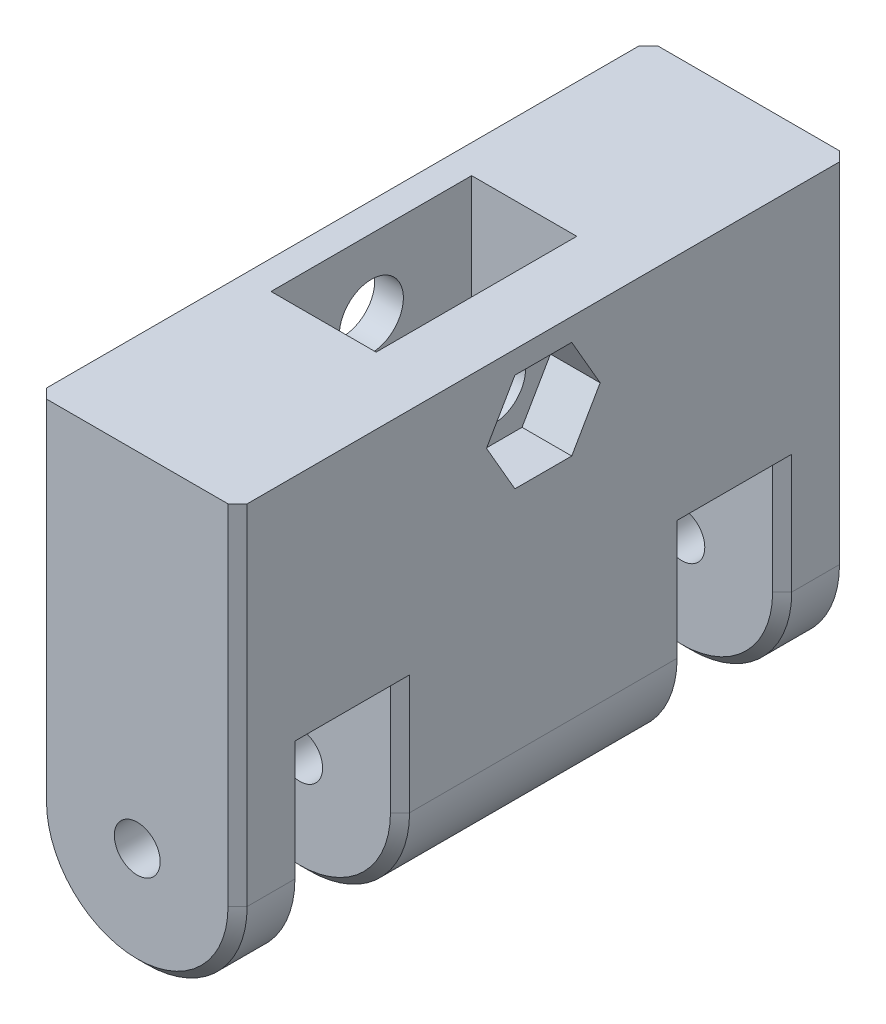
ISO-10303-21;
HEADER;
FILE_DESCRIPTION(('STEP AP214'),'2;1');
FILE_NAME('part.step','',(''),(''),'','','');
FILE_SCHEMA(('AUTOMOTIVE_DESIGN { 1 0 10303 214 1 1 1 1 }'));
ENDSEC;
DATA;
#1=APPLICATION_CONTEXT('core data for automotive mechanical design processes');
#2=APPLICATION_PROTOCOL_DEFINITION('international standard','automotive_design',2000,#1);
#3=PRODUCT_CONTEXT('',#1,'mechanical');
#4=PRODUCT('Part','Part','',(#3));
#5=PRODUCT_RELATED_PRODUCT_CATEGORY('part','',(#4));
#6=PRODUCT_DEFINITION_FORMATION('','',#4);
#7=PRODUCT_DEFINITION_CONTEXT('part definition',#1,'design');
#8=PRODUCT_DEFINITION('design','',#6,#7);
#9=PRODUCT_DEFINITION_SHAPE('','',#8);
#10=(LENGTH_UNIT() NAMED_UNIT(*) SI_UNIT(.MILLI.,.METRE.));
#11=(NAMED_UNIT(*) PLANE_ANGLE_UNIT() SI_UNIT($,.RADIAN.));
#12=(NAMED_UNIT(*) SI_UNIT($,.STERADIAN.) SOLID_ANGLE_UNIT());
#13=UNCERTAINTY_MEASURE_WITH_UNIT(LENGTH_MEASURE(1.E-05),#10,'distance_accuracy_value','');
#14=(GEOMETRIC_REPRESENTATION_CONTEXT(3) GLOBAL_UNCERTAINTY_ASSIGNED_CONTEXT((#13)) GLOBAL_UNIT_ASSIGNED_CONTEXT((#10,
#11,#12)) REPRESENTATION_CONTEXT('',''));
#15=CARTESIAN_POINT('',(0.,0.,0.));
#16=DIRECTION('',(0.,0.,1.));
#17=DIRECTION('',(1.,0.,0.));
#18=AXIS2_PLACEMENT_3D('',#15,#16,#17);
#19=CARTESIAN_POINT('',(-21.,0.,32.));
#20=DIRECTION('',(0.,1.,0.));
#21=DIRECTION('',(-1.,0.,0.));
#22=AXIS2_PLACEMENT_3D('',#19,#20,#21);
#23=PLANE('',#22);
#24=DIRECTION('',(-1.,0.,0.));
#25=VECTOR('',#24,1.);
#26=CARTESIAN_POINT('',(-21.,0.,-25.));
#27=LINE('',#26,#25);
#28=CARTESIAN_POINT('',(-1.00000000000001,0.,-25.));
#29=VERTEX_POINT('',#28);
#30=CARTESIAN_POINT('',(-20.,0.,-25.));
#31=VERTEX_POINT('',#30);
#32=EDGE_CURVE('E692',#29,#31,#27,.T.);
#33=ORIENTED_EDGE('',*,*,#32,.F.);
#34=DIRECTION('',(0.,0.,1.));
#35=VECTOR('',#34,1.);
#36=CARTESIAN_POINT('',(-1.00000000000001,0.,32.));
#37=LINE('',#36,#35);
#38=CARTESIAN_POINT('',(-1.,0.,-15.));
#39=VERTEX_POINT('',#38);
#40=EDGE_CURVE('E501',#29,#39,#37,.T.);
#41=ORIENTED_EDGE('',*,*,#40,.T.);
#42=DIRECTION('',(1.,0.,0.));
#43=VECTOR('',#42,1.);
#44=CARTESIAN_POINT('',(-21.,0.,-15.));
#45=LINE('',#44,#43);
#46=CARTESIAN_POINT('',(-20.,0.,-15.));
#47=VERTEX_POINT('',#46);
#48=EDGE_CURVE('E695',#47,#39,#45,.T.);
#49=ORIENTED_EDGE('',*,*,#48,.F.);
#50=DIRECTION('',(0.,0.,-1.));
#51=VECTOR('',#50,1.);
#52=CARTESIAN_POINT('',(-20.,0.,32.));
#53=LINE('',#52,#51);
#54=EDGE_CURVE('E499',#47,#31,#53,.T.);
#55=ORIENTED_EDGE('',*,*,#54,.T.);
#56=EDGE_LOOP('',(#33,#41,#49,#55));
#57=FACE_BOUND('',#56,.T.);
#58=ADVANCED_FACE('F37',(#57),#23,.F.);
#59=DIRECTION('',(-1.,0.,0.));
#60=VECTOR('',#59,1.);
#61=CARTESIAN_POINT('',(-21.,0.,15.));
#62=LINE('',#61,#60);
#63=CARTESIAN_POINT('',(-1.,0.,15.));
#64=VERTEX_POINT('',#63);
#65=CARTESIAN_POINT('',(-20.,0.,15.));
#66=VERTEX_POINT('',#65);
#67=EDGE_CURVE('E701',#64,#66,#62,.T.);
#68=ORIENTED_EDGE('',*,*,#67,.F.);
#69=DIRECTION('',(0.,0.,1.));
#70=VECTOR('',#69,1.);
#71=CARTESIAN_POINT('',(-1.00000000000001,0.,32.));
#72=LINE('',#71,#70);
#73=CARTESIAN_POINT('',(-1.,0.,25.));
#74=VERTEX_POINT('',#73);
#75=EDGE_CURVE('E505',#64,#74,#72,.T.);
#76=ORIENTED_EDGE('',*,*,#75,.T.);
#77=DIRECTION('',(1.,0.,0.));
#78=VECTOR('',#77,1.);
#79=CARTESIAN_POINT('',(-21.,0.,25.));
#80=LINE('',#79,#78);
#81=CARTESIAN_POINT('',(-20.,0.,25.));
#82=VERTEX_POINT('',#81);
#83=EDGE_CURVE('E327',#82,#74,#80,.T.);
#84=ORIENTED_EDGE('',*,*,#83,.F.);
#85=DIRECTION('',(0.,0.,-1.));
#86=VECTOR('',#85,1.);
#87=CARTESIAN_POINT('',(-20.,0.,32.));
#88=LINE('',#87,#86);
#89=EDGE_CURVE('E503',#82,#66,#88,.T.);
#90=ORIENTED_EDGE('',*,*,#89,.T.);
#91=EDGE_LOOP('',(#68,#76,#84,#90));
#92=FACE_BOUND('',#91,.T.);
#93=ADVANCED_FACE('F720',(#92),#23,.F.);
#94=CARTESIAN_POINT('',(0.,17.5,0.));
#95=DIRECTION('',(-1.,0.,0.));
#96=DIRECTION('',(0.,-1.,0.));
#97=AXIS2_PLACEMENT_3D('',#94,#95,#96);
#98=CYLINDRICAL_SURFACE('',#97,3.35);
#99=CARTESIAN_POINT('',(-7.,17.5,0.));
#100=DIRECTION('',(1.,0.,0.));
#101=DIRECTION('',(0.,0.,-1.));
#102=AXIS2_PLACEMENT_3D('',#99,#100,#101);
#103=CIRCLE('',#102,3.35);
#104=CARTESIAN_POINT('',(-7.,17.5,-3.35));
#105=VERTEX_POINT('',#104);
#106=EDGE_CURVE('E362',#105,#105,#103,.T.);
#107=ORIENTED_EDGE('',*,*,#106,.F.);
#108=EDGE_LOOP('',(#107));
#109=FACE_BOUND('',#108,.T.);
#110=CARTESIAN_POINT('',(-5.2,17.5,0.));
#111=DIRECTION('',(1.,0.,0.));
#112=DIRECTION('',(0.,0.,-1.));
#113=AXIS2_PLACEMENT_3D('',#110,#111,#112);
#114=CIRCLE('',#113,3.35);
#115=CARTESIAN_POINT('',(-5.2,17.5,-3.35));
#116=VERTEX_POINT('',#115);
#117=EDGE_CURVE('E350',#116,#116,#114,.F.);
#118=ORIENTED_EDGE('',*,*,#117,.F.);
#119=EDGE_LOOP('',(#118));
#120=FACE_BOUND('',#119,.T.);
#121=ADVANCED_FACE('F843',(#109,#120),#98,.F.);
#122=CARTESIAN_POINT('',(-21.,25.,32.));
#123=DIRECTION('',(1.,0.,0.));
#124=DIRECTION('',(0.,1.,0.));
#125=AXIS2_PLACEMENT_3D('',#122,#123,#124);
#126=PLANE('',#125);
#127=CARTESIAN_POINT('',(-21.,17.5,0.));
#128=DIRECTION('',(1.,0.,0.));
#129=DIRECTION('',(0.,1.,0.));
#130=AXIS2_PLACEMENT_3D('',#127,#128,#129);
#131=CIRCLE('',#130,3.35);
#132=CARTESIAN_POINT('',(-21.,20.85,0.));
#133=VERTEX_POINT('',#132);
#134=EDGE_CURVE('E361',#133,#133,#131,.T.);
#135=ORIENTED_EDGE('',*,*,#134,.T.);
#136=EDGE_LOOP('',(#135));
#137=FACE_BOUND('',#136,.T.);
#138=DIRECTION('',(0.,0.,-1.));
#139=VECTOR('',#138,1.);
#140=CARTESIAN_POINT('',(-21.,-11.5,32.));
#141=LINE('',#140,#139);
#142=CARTESIAN_POINT('',(-21.,-11.5,-31.));
#143=VERTEX_POINT('',#142);
#144=CARTESIAN_POINT('',(-21.,-11.5,-26.));
#145=VERTEX_POINT('',#144);
#146=EDGE_CURVE('E433',#143,#145,#141,.F.);
#147=ORIENTED_EDGE('',*,*,#146,.T.);
#148=DIRECTION('',(0.,1.,0.));
#149=VECTOR('',#148,1.);
#150=CARTESIAN_POINT('',(-21.,25.,-26.));
#151=LINE('',#150,#149);
#152=CARTESIAN_POINT('',(-21.,1.00000000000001,-26.));
#153=VERTEX_POINT('',#152);
#154=EDGE_CURVE('E461',#145,#153,#151,.T.);
#155=ORIENTED_EDGE('',*,*,#154,.T.);
#156=DIRECTION('',(0.,0.,1.));
#157=VECTOR('',#156,1.);
#158=CARTESIAN_POINT('',(-21.,1.00000000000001,32.));
#159=LINE('',#158,#157);
#160=CARTESIAN_POINT('',(-21.,1.00000000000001,-14.));
#161=VERTEX_POINT('',#160);
#162=EDGE_CURVE('E459',#153,#161,#159,.T.);
#163=ORIENTED_EDGE('',*,*,#162,.T.);
#164=DIRECTION('',(0.,-1.,0.));
#165=VECTOR('',#164,1.);
#166=CARTESIAN_POINT('',(-21.,25.,-14.));
#167=LINE('',#166,#165);
#168=CARTESIAN_POINT('',(-21.,-11.5,-14.));
#169=VERTEX_POINT('',#168);
#170=EDGE_CURVE('E457',#161,#169,#167,.T.);
#171=ORIENTED_EDGE('',*,*,#170,.T.);
#172=DIRECTION('',(0.,0.,-1.));
#173=VECTOR('',#172,1.);
#174=CARTESIAN_POINT('',(-21.,-11.5,15.));
#175=LINE('',#174,#173);
#176=CARTESIAN_POINT('',(-21.,-11.5,14.));
#177=VERTEX_POINT('',#176);
#178=EDGE_CURVE('E427',#169,#177,#175,.F.);
#179=ORIENTED_EDGE('',*,*,#178,.T.);
#180=DIRECTION('',(0.,1.,0.));
#181=VECTOR('',#180,1.);
#182=CARTESIAN_POINT('',(-21.,25.,14.));
#183=LINE('',#182,#181);
#184=CARTESIAN_POINT('',(-21.,1.00000000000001,14.));
#185=VERTEX_POINT('',#184);
#186=EDGE_CURVE('E455',#177,#185,#183,.T.);
#187=ORIENTED_EDGE('',*,*,#186,.T.);
#188=DIRECTION('',(0.,0.,1.));
#189=VECTOR('',#188,1.);
#190=CARTESIAN_POINT('',(-21.,1.00000000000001,32.));
#191=LINE('',#190,#189);
#192=CARTESIAN_POINT('',(-21.,1.00000000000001,26.));
#193=VERTEX_POINT('',#192);
#194=EDGE_CURVE('E453',#185,#193,#191,.T.);
#195=ORIENTED_EDGE('',*,*,#194,.T.);
#196=DIRECTION('',(0.,-1.,0.));
#197=VECTOR('',#196,1.);
#198=CARTESIAN_POINT('',(-21.,25.,26.));
#199=LINE('',#198,#197);
#200=CARTESIAN_POINT('',(-21.,-11.5,26.));
#201=VERTEX_POINT('',#200);
#202=EDGE_CURVE('E451',#193,#201,#199,.T.);
#203=ORIENTED_EDGE('',*,*,#202,.T.);
#204=DIRECTION('',(0.,0.,-1.));
#205=VECTOR('',#204,1.);
#206=CARTESIAN_POINT('',(-21.,-11.5,32.));
#207=LINE('',#206,#205);
#208=CARTESIAN_POINT('',(-21.,-11.5,31.));
#209=VERTEX_POINT('',#208);
#210=EDGE_CURVE('E430',#201,#209,#207,.F.);
#211=ORIENTED_EDGE('',*,*,#210,.T.);
#212=DIRECTION('',(0.,1.,0.));
#213=VECTOR('',#212,1.);
#214=CARTESIAN_POINT('',(-21.,25.,31.));
#215=LINE('',#214,#213);
#216=CARTESIAN_POINT('',(-21.,25.,31.));
#217=VERTEX_POINT('',#216);
#218=EDGE_CURVE('E436',#209,#217,#215,.T.);
#219=ORIENTED_EDGE('',*,*,#218,.T.);
#220=DIRECTION('',(0.,0.,-1.));
#221=VECTOR('',#220,1.);
#222=CARTESIAN_POINT('',(-21.,25.,32.));
#223=LINE('',#222,#221);
#224=CARTESIAN_POINT('',(-21.,25.,-31.));
#225=VERTEX_POINT('',#224);
#226=EDGE_CURVE('E401',#217,#225,#223,.T.);
#227=ORIENTED_EDGE('',*,*,#226,.T.);
#228=DIRECTION('',(0.,-1.,0.));
#229=VECTOR('',#228,1.);
#230=CARTESIAN_POINT('',(-21.,25.,-31.));
#231=LINE('',#230,#229);
#232=EDGE_CURVE('E449',#225,#143,#231,.T.);
#233=ORIENTED_EDGE('',*,*,#232,.T.);
#234=EDGE_LOOP('',(#147,#155,#163,#171,#179,#187,#195,#203,#211,#219,#227,#233));
#235=FACE_BOUND('',#234,.T.);
#236=ADVANCED_FACE('F649',(#137,#235),#126,.F.);
#237=CARTESIAN_POINT('',(0.,25.,32.));
#238=DIRECTION('',(-1.,0.,0.));
#239=DIRECTION('',(0.,0.,1.));
#240=AXIS2_PLACEMENT_3D('',#237,#238,#239);
#241=PLANE('',#240);
#242=DIRECTION('',(0.,0.,1.));
#243=VECTOR('',#242,1.);
#244=CARTESIAN_POINT('',(0.,22.65,-2.97335388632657));
#245=LINE('',#244,#243);
#246=CARTESIAN_POINT('',(0.,22.65,-2.97335388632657));
#247=VERTEX_POINT('',#246);
#248=CARTESIAN_POINT('',(0.,22.65,2.97335388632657));
#249=VERTEX_POINT('',#248);
#250=EDGE_CURVE('E338',#247,#249,#245,.T.);
#251=ORIENTED_EDGE('',*,*,#250,.F.);
#252=DIRECTION('',(0.,0.866025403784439,0.5));
#253=VECTOR('',#252,1.);
#254=CARTESIAN_POINT('',(0.,17.5,-5.94670777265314));
#255=LINE('',#254,#253);
#256=CARTESIAN_POINT('',(0.,17.5,-5.94670777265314));
#257=VERTEX_POINT('',#256);
#258=EDGE_CURVE('E302',#257,#247,#255,.T.);
#259=ORIENTED_EDGE('',*,*,#258,.F.);
#260=DIRECTION('',(0.,0.866025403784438,-0.5));
#261=VECTOR('',#260,1.);
#262=CARTESIAN_POINT('',(0.,12.35,-2.97335388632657));
#263=LINE('',#262,#261);
#264=CARTESIAN_POINT('',(0.,12.35,-2.97335388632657));
#265=VERTEX_POINT('',#264);
#266=EDGE_CURVE('E321',#265,#257,#263,.T.);
#267=ORIENTED_EDGE('',*,*,#266,.F.);
#268=DIRECTION('',(0.,0.,-1.));
#269=VECTOR('',#268,1.);
#270=CARTESIAN_POINT('',(0.,12.35,2.97335388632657));
#271=LINE('',#270,#269);
#272=CARTESIAN_POINT('',(0.,12.35,2.97335388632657));
#273=VERTEX_POINT('',#272);
#274=EDGE_CURVE('E324',#273,#265,#271,.T.);
#275=ORIENTED_EDGE('',*,*,#274,.F.);
#276=DIRECTION('',(0.,-0.866025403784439,-0.5));
#277=VECTOR('',#276,1.);
#278=CARTESIAN_POINT('',(0.,17.5,5.94670777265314));
#279=LINE('',#278,#277);
#280=CARTESIAN_POINT('',(0.,17.5,5.94670777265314));
#281=VERTEX_POINT('',#280);
#282=EDGE_CURVE('E343',#281,#273,#279,.T.);
#283=ORIENTED_EDGE('',*,*,#282,.F.);
#284=DIRECTION('',(0.,-0.866025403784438,0.5));
#285=VECTOR('',#284,1.);
#286=CARTESIAN_POINT('',(0.,22.65,2.97335388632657));
#287=LINE('',#286,#285);
#288=EDGE_CURVE('E340',#249,#281,#287,.T.);
#289=ORIENTED_EDGE('',*,*,#288,.F.);
#290=EDGE_LOOP('',(#251,#259,#267,#275,#283,#289));
#291=FACE_BOUND('',#290,.T.);
#292=DIRECTION('',(0.,0.,-1.));
#293=VECTOR('',#292,1.);
#294=CARTESIAN_POINT('',(0.,1.00000000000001,32.));
#295=LINE('',#294,#293);
#296=CARTESIAN_POINT('',(0.,1.00000000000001,-14.));
#297=VERTEX_POINT('',#296);
#298=CARTESIAN_POINT('',(0.,1.00000000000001,-26.));
#299=VERTEX_POINT('',#298);
#300=EDGE_CURVE('E495',#297,#299,#295,.T.);
#301=ORIENTED_EDGE('',*,*,#300,.T.);
#302=DIRECTION('',(0.,-1.,0.));
#303=VECTOR('',#302,1.);
#304=CARTESIAN_POINT('',(0.,25.,-26.));
#305=LINE('',#304,#303);
#306=CARTESIAN_POINT('',(0.,-11.5,-26.));
#307=VERTEX_POINT('',#306);
#308=EDGE_CURVE('E497',#299,#307,#305,.T.);
#309=ORIENTED_EDGE('',*,*,#308,.T.);
#310=DIRECTION('',(0.,0.,1.));
#311=VECTOR('',#310,1.);
#312=CARTESIAN_POINT('',(0.,-11.5,32.));
#313=LINE('',#312,#311);
#314=CARTESIAN_POINT('',(0.,-11.5,-31.));
#315=VERTEX_POINT('',#314);
#316=EDGE_CURVE('E424',#307,#315,#313,.F.);
#317=ORIENTED_EDGE('',*,*,#316,.T.);
#318=DIRECTION('',(0.,1.,0.));
#319=VECTOR('',#318,1.);
#320=CARTESIAN_POINT('',(0.,25.,-31.));
#321=LINE('',#320,#319);
#322=CARTESIAN_POINT('',(0.,25.,-31.));
#323=VERTEX_POINT('',#322);
#324=EDGE_CURVE('E483',#315,#323,#321,.T.);
#325=ORIENTED_EDGE('',*,*,#324,.T.);
#326=DIRECTION('',(0.,0.,-1.));
#327=VECTOR('',#326,1.);
#328=CARTESIAN_POINT('',(0.,25.,32.));
#329=LINE('',#328,#327);
#330=CARTESIAN_POINT('',(0.,25.,31.));
#331=VERTEX_POINT('',#330);
#332=EDGE_CURVE('E406',#331,#323,#329,.T.);
#333=ORIENTED_EDGE('',*,*,#332,.F.);
#334=DIRECTION('',(0.,-1.,0.));
#335=VECTOR('',#334,1.);
#336=CARTESIAN_POINT('',(0.,-11.5,31.));
#337=LINE('',#336,#335);
#338=CARTESIAN_POINT('',(0.,-11.5,31.));
#339=VERTEX_POINT('',#338);
#340=EDGE_CURVE('E481',#331,#339,#337,.T.);
#341=ORIENTED_EDGE('',*,*,#340,.T.);
#342=DIRECTION('',(0.,0.,1.));
#343=VECTOR('',#342,1.);
#344=CARTESIAN_POINT('',(0.,-11.5,25.));
#345=LINE('',#344,#343);
#346=CARTESIAN_POINT('',(0.,-11.5,26.));
#347=VERTEX_POINT('',#346);
#348=EDGE_CURVE('E421',#339,#347,#345,.F.);
#349=ORIENTED_EDGE('',*,*,#348,.T.);
#350=DIRECTION('',(0.,1.,0.));
#351=VECTOR('',#350,1.);
#352=CARTESIAN_POINT('',(0.,25.,26.));
#353=LINE('',#352,#351);
#354=CARTESIAN_POINT('',(0.,1.00000000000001,26.));
#355=VERTEX_POINT('',#354);
#356=EDGE_CURVE('E486',#347,#355,#353,.T.);
#357=ORIENTED_EDGE('',*,*,#356,.T.);
#358=DIRECTION('',(0.,0.,-1.));
#359=VECTOR('',#358,1.);
#360=CARTESIAN_POINT('',(0.,1.00000000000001,32.));
#361=LINE('',#360,#359);
#362=CARTESIAN_POINT('',(0.,1.00000000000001,14.));
#363=VERTEX_POINT('',#362);
#364=EDGE_CURVE('E488',#355,#363,#361,.T.);
#365=ORIENTED_EDGE('',*,*,#364,.T.);
#366=DIRECTION('',(0.,-1.,0.));
#367=VECTOR('',#366,1.);
#368=CARTESIAN_POINT('',(0.,25.,14.));
#369=LINE('',#368,#367);
#370=CARTESIAN_POINT('',(0.,-11.5,14.));
#371=VERTEX_POINT('',#370);
#372=EDGE_CURVE('E491',#363,#371,#369,.T.);
#373=ORIENTED_EDGE('',*,*,#372,.T.);
#374=DIRECTION('',(0.,0.,1.));
#375=VECTOR('',#374,1.);
#376=CARTESIAN_POINT('',(0.,-11.5,-15.));
#377=LINE('',#376,#375);
#378=CARTESIAN_POINT('',(0.,-11.5,-14.));
#379=VERTEX_POINT('',#378);
#380=EDGE_CURVE('E409',#371,#379,#377,.F.);
#381=ORIENTED_EDGE('',*,*,#380,.T.);
#382=DIRECTION('',(0.,1.,0.));
#383=VECTOR('',#382,1.);
#384=CARTESIAN_POINT('',(0.,25.,-14.));
#385=LINE('',#384,#383);
#386=EDGE_CURVE('E493',#379,#297,#385,.T.);
#387=ORIENTED_EDGE('',*,*,#386,.T.);
#388=EDGE_LOOP('',(#301,#309,#317,#325,#333,#341,#349,#357,#365,#373,#381,#387));
#389=FACE_BOUND('',#388,.T.);
#390=ADVANCED_FACE('F752',(#291,#389),#241,.F.);
#391=CARTESIAN_POINT('',(-21.,25.,32.));
#392=DIRECTION('',(0.,-1.,0.));
#393=DIRECTION('',(1.,0.,0.));
#394=AXIS2_PLACEMENT_3D('',#391,#392,#393);
#395=PLANE('',#394);
#396=DIRECTION('',(1.,0.,0.));
#397=VECTOR('',#396,1.);
#398=CARTESIAN_POINT('',(-18.,25.,10.5));
#399=LINE('',#398,#397);
#400=CARTESIAN_POINT('',(-18.,25.,10.5));
#401=VERTEX_POINT('',#400);
#402=CARTESIAN_POINT('',(-7.,25.,10.5));
#403=VERTEX_POINT('',#402);
#404=EDGE_CURVE('E381',#401,#403,#399,.T.);
#405=ORIENTED_EDGE('',*,*,#404,.F.);
#406=DIRECTION('',(0.,0.,1.));
#407=VECTOR('',#406,1.);
#408=CARTESIAN_POINT('',(-18.,25.,-10.5));
#409=LINE('',#408,#407);
#410=CARTESIAN_POINT('',(-18.,25.,-10.5));
#411=VERTEX_POINT('',#410);
#412=EDGE_CURVE('E365',#411,#401,#409,.T.);
#413=ORIENTED_EDGE('',*,*,#412,.F.);
#414=DIRECTION('',(-1.,0.,0.));
#415=VECTOR('',#414,1.);
#416=CARTESIAN_POINT('',(-18.,25.,-10.5));
#417=LINE('',#416,#415);
#418=CARTESIAN_POINT('',(-7.,25.,-10.5));
#419=VERTEX_POINT('',#418);
#420=EDGE_CURVE('E370',#419,#411,#417,.T.);
#421=ORIENTED_EDGE('',*,*,#420,.F.);
#422=DIRECTION('',(0.,0.,-1.));
#423=VECTOR('',#422,1.);
#424=CARTESIAN_POINT('',(-7.,25.,-10.5));
#425=LINE('',#424,#423);
#426=EDGE_CURVE('E384',#403,#419,#425,.T.);
#427=ORIENTED_EDGE('',*,*,#426,.F.);
#428=EDGE_LOOP('',(#405,#413,#421,#427));
#429=FACE_BOUND('',#428,.T.);
#430=ORIENTED_EDGE('',*,*,#332,.T.);
#431=DIRECTION('',(0.707106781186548,0.,0.707106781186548));
#432=VECTOR('',#431,1.);
#433=CARTESIAN_POINT('',(0.,25.,-31.));
#434=LINE('',#433,#432);
#435=CARTESIAN_POINT('',(-1.,25.,-32.));
#436=VERTEX_POINT('',#435);
#437=EDGE_CURVE('E554',#323,#436,#434,.F.);
#438=ORIENTED_EDGE('',*,*,#437,.T.);
#439=DIRECTION('',(-1.,0.,0.));
#440=VECTOR('',#439,1.);
#441=CARTESIAN_POINT('',(-21.,25.,-32.));
#442=LINE('',#441,#440);
#443=CARTESIAN_POINT('',(-20.,25.,-32.));
#444=VERTEX_POINT('',#443);
#445=EDGE_CURVE('E391',#436,#444,#442,.T.);
#446=ORIENTED_EDGE('',*,*,#445,.T.);
#447=DIRECTION('',(0.707106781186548,0.,-0.707106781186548));
#448=VECTOR('',#447,1.);
#449=CARTESIAN_POINT('',(-21.,25.,-31.));
#450=LINE('',#449,#448);
#451=EDGE_CURVE('E552',#444,#225,#450,.F.);
#452=ORIENTED_EDGE('',*,*,#451,.T.);
#453=ORIENTED_EDGE('',*,*,#226,.F.);
#454=DIRECTION('',(0.707106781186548,0.,0.707106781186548));
#455=VECTOR('',#454,1.);
#456=CARTESIAN_POINT('',(-20.,25.,32.));
#457=LINE('',#456,#455);
#458=CARTESIAN_POINT('',(-20.,25.,32.));
#459=VERTEX_POINT('',#458);
#460=EDGE_CURVE('E548',#217,#459,#457,.T.);
#461=ORIENTED_EDGE('',*,*,#460,.T.);
#462=DIRECTION('',(-1.,0.,0.));
#463=VECTOR('',#462,1.);
#464=CARTESIAN_POINT('',(-21.,25.,32.));
#465=LINE('',#464,#463);
#466=CARTESIAN_POINT('',(-0.999999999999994,25.,32.));
#467=VERTEX_POINT('',#466);
#468=EDGE_CURVE('E398',#467,#459,#465,.T.);
#469=ORIENTED_EDGE('',*,*,#468,.F.);
#470=DIRECTION('',(0.707106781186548,0.,-0.707106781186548));
#471=VECTOR('',#470,1.);
#472=CARTESIAN_POINT('',(-1.,25.,32.));
#473=LINE('',#472,#471);
#474=EDGE_CURVE('E550',#467,#331,#473,.T.);
#475=ORIENTED_EDGE('',*,*,#474,.T.);
#476=EDGE_LOOP('',(#430,#438,#446,#452,#453,#461,#469,#475));
#477=FACE_BOUND('',#476,.T.);
#478=ADVANCED_FACE('F653',(#429,#477),#395,.F.);
#479=CARTESIAN_POINT('',(0.,0.,32.));
#480=DIRECTION('',(0.,0.,1.));
#481=DIRECTION('',(1.,0.,0.));
#482=AXIS2_PLACEMENT_3D('',#479,#480,#481);
#483=PLANE('',#482);
#484=CARTESIAN_POINT('',(-10.5,-11.,32.));
#485=DIRECTION('',(0.,0.,1.));
#486=DIRECTION('',(1.,0.,0.));
#487=AXIS2_PLACEMENT_3D('',#484,#485,#486);
#488=CIRCLE('',#487,2.4);
#489=CARTESIAN_POINT('',(-8.1,-11.,32.));
#490=VERTEX_POINT('',#489);
#491=EDGE_CURVE('E440',#490,#490,#488,.T.);
#492=ORIENTED_EDGE('',*,*,#491,.F.);
#493=EDGE_LOOP('',(#492));
#494=FACE_BOUND('',#493,.T.);
#495=CARTESIAN_POINT('',(-10.5,-11.5,32.));
#496=DIRECTION('',(0.,0.,1.));
#497=DIRECTION('',(1.,0.,0.));
#498=AXIS2_PLACEMENT_3D('',#495,#496,#497);
#499=CIRCLE('',#498,9.50000000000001);
#500=CARTESIAN_POINT('',(-10.5,-21.,32.));
#501=VERTEX_POINT('',#500);
#502=CARTESIAN_POINT('',(-0.999999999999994,-11.5,32.));
#503=VERTEX_POINT('',#502);
#504=EDGE_CURVE('E47',#501,#503,#499,.T.);
#505=ORIENTED_EDGE('',*,*,#504,.T.);
#506=DIRECTION('',(0.,1.,0.));
#507=VECTOR('',#506,1.);
#508=CARTESIAN_POINT('',(-0.999999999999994,25.,32.));
#509=LINE('',#508,#507);
#510=EDGE_CURVE('E11',#503,#467,#509,.T.);
#511=ORIENTED_EDGE('',*,*,#510,.T.);
#512=ORIENTED_EDGE('',*,*,#468,.T.);
#513=DIRECTION('',(0.,-1.,0.));
#514=VECTOR('',#513,1.);
#515=CARTESIAN_POINT('',(-20.,-11.5,32.));
#516=LINE('',#515,#514);
#517=CARTESIAN_POINT('',(-20.,-11.5,32.));
#518=VERTEX_POINT('',#517);
#519=EDGE_CURVE('E564',#459,#518,#516,.T.);
#520=ORIENTED_EDGE('',*,*,#519,.T.);
#521=CARTESIAN_POINT('',(-10.5,-11.5,32.));
#522=DIRECTION('',(0.,0.,1.));
#523=DIRECTION('',(1.,0.,0.));
#524=AXIS2_PLACEMENT_3D('',#521,#522,#523);
#525=CIRCLE('',#524,9.50000000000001);
#526=EDGE_CURVE('E58',#518,#501,#525,.T.);
#527=ORIENTED_EDGE('',*,*,#526,.T.);
#528=EDGE_LOOP('',(#505,#511,#512,#520,#527));
#529=FACE_BOUND('',#528,.T.);
#530=ADVANCED_FACE('F759',(#494,#529),#483,.T.);
#531=CARTESIAN_POINT('',(0.,0.,-32.));
#532=DIRECTION('',(0.,0.,1.));
#533=DIRECTION('',(1.,0.,0.));
#534=AXIS2_PLACEMENT_3D('',#531,#532,#533);
#535=PLANE('',#534);
#536=CARTESIAN_POINT('',(-10.5,-11.,-32.));
#537=DIRECTION('',(0.,0.,1.));
#538=DIRECTION('',(1.,0.,0.));
#539=AXIS2_PLACEMENT_3D('',#536,#537,#538);
#540=CIRCLE('',#539,2.4);
#541=CARTESIAN_POINT('',(-8.1,-11.,-32.));
#542=VERTEX_POINT('',#541);
#543=EDGE_CURVE('E418',#542,#542,#540,.T.);
#544=ORIENTED_EDGE('',*,*,#543,.T.);
#545=EDGE_LOOP('',(#544));
#546=FACE_BOUND('',#545,.T.);
#547=ORIENTED_EDGE('',*,*,#445,.F.);
#548=DIRECTION('',(0.,-1.,0.));
#549=VECTOR('',#548,1.);
#550=CARTESIAN_POINT('',(-1.,0.,-32.));
#551=LINE('',#550,#549);
#552=CARTESIAN_POINT('',(-1.,-11.5,-32.));
#553=VERTEX_POINT('',#552);
#554=EDGE_CURVE('E562',#436,#553,#551,.T.);
#555=ORIENTED_EDGE('',*,*,#554,.T.);
#556=CARTESIAN_POINT('',(-10.5,-11.5,-32.));
#557=DIRECTION('',(0.,0.,1.));
#558=DIRECTION('',(1.,0.,0.));
#559=AXIS2_PLACEMENT_3D('',#556,#557,#558);
#560=CIRCLE('',#559,9.5);
#561=CARTESIAN_POINT('',(-10.5,-21.,-32.));
#562=VERTEX_POINT('',#561);
#563=EDGE_CURVE('E560',#553,#562,#560,.F.);
#564=ORIENTED_EDGE('',*,*,#563,.T.);
#565=CARTESIAN_POINT('',(-10.5,-11.5,-32.));
#566=DIRECTION('',(0.,0.,1.));
#567=DIRECTION('',(1.,0.,0.));
#568=AXIS2_PLACEMENT_3D('',#565,#566,#567);
#569=CIRCLE('',#568,9.5);
#570=CARTESIAN_POINT('',(-20.,-11.5,-32.));
#571=VERTEX_POINT('',#570);
#572=EDGE_CURVE('E558',#562,#571,#569,.F.);
#573=ORIENTED_EDGE('',*,*,#572,.T.);
#574=DIRECTION('',(0.,1.,0.));
#575=VECTOR('',#574,1.);
#576=CARTESIAN_POINT('',(-20.,0.,-32.));
#577=LINE('',#576,#575);
#578=EDGE_CURVE('E556',#571,#444,#577,.T.);
#579=ORIENTED_EDGE('',*,*,#578,.T.);
#580=EDGE_LOOP('',(#547,#555,#564,#573,#579));
#581=FACE_BOUND('',#580,.T.);
#582=ADVANCED_FACE('F767',(#546,#581),#535,.F.);
#583=CARTESIAN_POINT('',(-18.,6.50000000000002,-10.5));
#584=DIRECTION('',(-1.,0.,0.));
#585=DIRECTION('',(0.,0.,1.));
#586=AXIS2_PLACEMENT_3D('',#583,#584,#585);
#587=PLANE('',#586);
#588=CARTESIAN_POINT('',(-18.,17.5,0.));
#589=DIRECTION('',(-1.,0.,0.));
#590=DIRECTION('',(0.,0.,1.));
#591=AXIS2_PLACEMENT_3D('',#588,#589,#590);
#592=CIRCLE('',#591,3.35);
#593=CARTESIAN_POINT('',(-18.,17.5,3.35));
#594=VERTEX_POINT('',#593);
#595=EDGE_CURVE('E358',#594,#594,#592,.T.);
#596=ORIENTED_EDGE('',*,*,#595,.T.);
#597=EDGE_LOOP('',(#596));
#598=FACE_BOUND('',#597,.T.);
#599=ORIENTED_EDGE('',*,*,#412,.T.);
#600=DIRECTION('',(0.,1.,0.));
#601=VECTOR('',#600,1.);
#602=CARTESIAN_POINT('',(-18.,6.50000000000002,10.5));
#603=LINE('',#602,#601);
#604=CARTESIAN_POINT('',(-18.,6.50000000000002,10.5));
#605=VERTEX_POINT('',#604);
#606=EDGE_CURVE('E379',#605,#401,#603,.T.);
#607=ORIENTED_EDGE('',*,*,#606,.F.);
#608=DIRECTION('',(0.,0.,1.));
#609=VECTOR('',#608,1.);
#610=CARTESIAN_POINT('',(-18.,6.50000000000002,-10.5));
#611=LINE('',#610,#609);
#612=CARTESIAN_POINT('',(-18.,6.50000000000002,-10.5));
#613=VERTEX_POINT('',#612);
#614=EDGE_CURVE('E366',#613,#605,#611,.T.);
#615=ORIENTED_EDGE('',*,*,#614,.F.);
#616=DIRECTION('',(0.,1.,0.));
#617=VECTOR('',#616,1.);
#618=CARTESIAN_POINT('',(-18.,6.50000000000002,-10.5));
#619=LINE('',#618,#617);
#620=EDGE_CURVE('E389',#613,#411,#619,.T.);
#621=ORIENTED_EDGE('',*,*,#620,.T.);
#622=EDGE_LOOP('',(#599,#607,#615,#621));
#623=FACE_BOUND('',#622,.T.);
#624=ADVANCED_FACE('F1256',(#598,#623),#587,.F.);
#625=CARTESIAN_POINT('',(-18.,6.50000000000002,-10.5));
#626=DIRECTION('',(0.,0.,-1.));
#627=DIRECTION('',(-1.,0.,0.));
#628=AXIS2_PLACEMENT_3D('',#625,#626,#627);
#629=PLANE('',#628);
#630=ORIENTED_EDGE('',*,*,#420,.T.);
#631=ORIENTED_EDGE('',*,*,#620,.F.);
#632=DIRECTION('',(-1.,0.,0.));
#633=VECTOR('',#632,1.);
#634=CARTESIAN_POINT('',(-18.,6.50000000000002,-10.5));
#635=LINE('',#634,#633);
#636=CARTESIAN_POINT('',(-7.,6.50000000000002,-10.5));
#637=VERTEX_POINT('',#636);
#638=EDGE_CURVE('E376',#637,#613,#635,.T.);
#639=ORIENTED_EDGE('',*,*,#638,.F.);
#640=DIRECTION('',(0.,1.,0.));
#641=VECTOR('',#640,1.);
#642=CARTESIAN_POINT('',(-7.,6.50000000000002,-10.5));
#643=LINE('',#642,#641);
#644=EDGE_CURVE('E392',#637,#419,#643,.T.);
#645=ORIENTED_EDGE('',*,*,#644,.T.);
#646=EDGE_LOOP('',(#630,#631,#639,#645));
#647=FACE_BOUND('',#646,.T.);
#648=ADVANCED_FACE('F1304',(#647),#629,.F.);
#649=CARTESIAN_POINT('',(-7.,6.50000000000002,-10.5));
#650=DIRECTION('',(1.,0.,0.));
#651=DIRECTION('',(0.,0.,-1.));
#652=AXIS2_PLACEMENT_3D('',#649,#650,#651);
#653=PLANE('',#652);
#654=ORIENTED_EDGE('',*,*,#106,.T.);
#655=EDGE_LOOP('',(#654));
#656=FACE_BOUND('',#655,.T.);
#657=ORIENTED_EDGE('',*,*,#426,.T.);
#658=ORIENTED_EDGE('',*,*,#644,.F.);
#659=DIRECTION('',(0.,0.,-1.));
#660=VECTOR('',#659,1.);
#661=CARTESIAN_POINT('',(-7.,6.50000000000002,-10.5));
#662=LINE('',#661,#660);
#663=CARTESIAN_POINT('',(-7.,6.50000000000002,10.5));
#664=VERTEX_POINT('',#663);
#665=EDGE_CURVE('E373',#664,#637,#662,.T.);
#666=ORIENTED_EDGE('',*,*,#665,.F.);
#667=DIRECTION('',(0.,1.,0.));
#668=VECTOR('',#667,1.);
#669=CARTESIAN_POINT('',(-7.,6.50000000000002,10.5));
#670=LINE('',#669,#668);
#671=EDGE_CURVE('E394',#664,#403,#670,.T.);
#672=ORIENTED_EDGE('',*,*,#671,.T.);
#673=EDGE_LOOP('',(#657,#658,#666,#672));
#674=FACE_BOUND('',#673,.T.);
#675=ADVANCED_FACE('F1313',(#656,#674),#653,.F.);
#676=CARTESIAN_POINT('',(-18.,6.50000000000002,10.5));
#677=DIRECTION('',(0.,0.,1.));
#678=DIRECTION('',(1.,0.,0.));
#679=AXIS2_PLACEMENT_3D('',#676,#677,#678);
#680=PLANE('',#679);
#681=ORIENTED_EDGE('',*,*,#404,.T.);
#682=ORIENTED_EDGE('',*,*,#671,.F.);
#683=DIRECTION('',(1.,0.,0.));
#684=VECTOR('',#683,1.);
#685=CARTESIAN_POINT('',(-18.,6.50000000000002,10.5));
#686=LINE('',#685,#684);
#687=EDGE_CURVE('E369',#605,#664,#686,.T.);
#688=ORIENTED_EDGE('',*,*,#687,.F.);
#689=ORIENTED_EDGE('',*,*,#606,.T.);
#690=EDGE_LOOP('',(#681,#682,#688,#689));
#691=FACE_BOUND('',#690,.T.);
#692=ADVANCED_FACE('F1321',(#691),#680,.F.);
#693=CARTESIAN_POINT('',(0.,6.50000000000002,0.));
#694=DIRECTION('',(0.,1.,0.));
#695=DIRECTION('',(0.,0.,1.));
#696=AXIS2_PLACEMENT_3D('',#693,#694,#695);
#697=PLANE('',#696);
#698=ORIENTED_EDGE('',*,*,#614,.T.);
#699=ORIENTED_EDGE('',*,*,#687,.T.);
#700=ORIENTED_EDGE('',*,*,#665,.T.);
#701=ORIENTED_EDGE('',*,*,#638,.T.);
#702=EDGE_LOOP('',(#698,#699,#700,#701));
#703=FACE_BOUND('',#702,.T.);
#704=ADVANCED_FACE('F1329',(#703),#697,.T.);
#705=ORIENTED_EDGE('',*,*,#595,.F.);
#706=EDGE_LOOP('',(#705));
#707=FACE_BOUND('',#706,.T.);
#708=ORIENTED_EDGE('',*,*,#134,.F.);
#709=EDGE_LOOP('',(#708));
#710=FACE_BOUND('',#709,.T.);
#711=ADVANCED_FACE('F1336',(#707,#710),#98,.F.);
#712=CARTESIAN_POINT('',(-5.2,0.,0.));
#713=DIRECTION('',(1.,0.,0.));
#714=DIRECTION('',(0.,0.,-1.));
#715=AXIS2_PLACEMENT_3D('',#712,#713,#714);
#716=PLANE('',#715);
#717=DIRECTION('',(0.,0.866025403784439,0.5));
#718=VECTOR('',#717,1.);
#719=CARTESIAN_POINT('',(-5.2,17.5,-5.94670777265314));
#720=LINE('',#719,#718);
#721=CARTESIAN_POINT('',(-5.2,17.5,-5.94670777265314));
#722=VERTEX_POINT('',#721);
#723=CARTESIAN_POINT('',(-5.2,22.65,-2.97335388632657));
#724=VERTEX_POINT('',#723);
#725=EDGE_CURVE('E299',#722,#724,#720,.T.);
#726=ORIENTED_EDGE('',*,*,#725,.T.);
#727=DIRECTION('',(0.,0.,1.));
#728=VECTOR('',#727,1.);
#729=CARTESIAN_POINT('',(-5.2,22.65,-2.97335388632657));
#730=LINE('',#729,#728);
#731=CARTESIAN_POINT('',(-5.2,22.65,2.97335388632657));
#732=VERTEX_POINT('',#731);
#733=EDGE_CURVE('E310',#724,#732,#730,.T.);
#734=ORIENTED_EDGE('',*,*,#733,.T.);
#735=DIRECTION('',(0.,-0.866025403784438,0.5));
#736=VECTOR('',#735,1.);
#737=CARTESIAN_POINT('',(-5.2,22.65,2.97335388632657));
#738=LINE('',#737,#736);
#739=CARTESIAN_POINT('',(-5.2,17.5,5.94670777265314));
#740=VERTEX_POINT('',#739);
#741=EDGE_CURVE('E315',#732,#740,#738,.T.);
#742=ORIENTED_EDGE('',*,*,#741,.T.);
#743=DIRECTION('',(0.,-0.866025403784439,-0.5));
#744=VECTOR('',#743,1.);
#745=CARTESIAN_POINT('',(-5.2,17.5,5.94670777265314));
#746=LINE('',#745,#744);
#747=CARTESIAN_POINT('',(-5.2,12.35,2.97335388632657));
#748=VERTEX_POINT('',#747);
#749=EDGE_CURVE('E331',#740,#748,#746,.T.);
#750=ORIENTED_EDGE('',*,*,#749,.T.);
#751=DIRECTION('',(0.,0.,-1.));
#752=VECTOR('',#751,1.);
#753=CARTESIAN_POINT('',(-5.2,12.35,2.97335388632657));
#754=LINE('',#753,#752);
#755=CARTESIAN_POINT('',(-5.2,12.35,-2.97335388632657));
#756=VERTEX_POINT('',#755);
#757=EDGE_CURVE('E334',#748,#756,#754,.T.);
#758=ORIENTED_EDGE('',*,*,#757,.T.);
#759=DIRECTION('',(0.,0.866025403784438,-0.5));
#760=VECTOR('',#759,1.);
#761=CARTESIAN_POINT('',(-5.2,12.35,-2.97335388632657));
#762=LINE('',#761,#760);
#763=EDGE_CURVE('E307',#756,#722,#762,.T.);
#764=ORIENTED_EDGE('',*,*,#763,.T.);
#765=EDGE_LOOP('',(#726,#734,#742,#750,#758,#764));
#766=FACE_BOUND('',#765,.T.);
#767=ORIENTED_EDGE('',*,*,#117,.T.);
#768=EDGE_LOOP('',(#767));
#769=FACE_BOUND('',#768,.T.);
#770=ADVANCED_FACE('F317',(#766,#769),#716,.T.);
#771=CARTESIAN_POINT('',(-5.2,17.5,-5.94670777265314));
#772=DIRECTION('',(0.,0.5,-0.866025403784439));
#773=DIRECTION('',(0.,0.866025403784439,0.5));
#774=AXIS2_PLACEMENT_3D('',#771,#772,#773);
#775=PLANE('',#774);
#776=ORIENTED_EDGE('',*,*,#258,.T.);
#777=DIRECTION('',(1.,0.,0.));
#778=VECTOR('',#777,1.);
#779=CARTESIAN_POINT('',(-5.2,22.65,-2.97335388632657));
#780=LINE('',#779,#778);
#781=EDGE_CURVE('E295',#724,#247,#780,.T.);
#782=ORIENTED_EDGE('',*,*,#781,.F.);
#783=ORIENTED_EDGE('',*,*,#725,.F.);
#784=DIRECTION('',(1.,0.,0.));
#785=VECTOR('',#784,1.);
#786=CARTESIAN_POINT('',(-5.2,17.5,-5.94670777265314));
#787=LINE('',#786,#785);
#788=EDGE_CURVE('E348',#722,#257,#787,.T.);
#789=ORIENTED_EDGE('',*,*,#788,.T.);
#790=EDGE_LOOP('',(#776,#782,#783,#789));
#791=FACE_BOUND('',#790,.T.);
#792=ADVANCED_FACE('F297',(#791),#775,.F.);
#793=CARTESIAN_POINT('',(-5.2,12.35,-2.97335388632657));
#794=DIRECTION('',(0.,-0.5,-0.866025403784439));
#795=DIRECTION('',(0.,0.866025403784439,-0.5));
#796=AXIS2_PLACEMENT_3D('',#793,#794,#795);
#797=PLANE('',#796);
#798=ORIENTED_EDGE('',*,*,#266,.T.);
#799=ORIENTED_EDGE('',*,*,#788,.F.);
#800=ORIENTED_EDGE('',*,*,#763,.F.);
#801=DIRECTION('',(1.,0.,0.));
#802=VECTOR('',#801,1.);
#803=CARTESIAN_POINT('',(-5.2,12.35,-2.97335388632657));
#804=LINE('',#803,#802);
#805=EDGE_CURVE('E351',#756,#265,#804,.T.);
#806=ORIENTED_EDGE('',*,*,#805,.T.);
#807=EDGE_LOOP('',(#798,#799,#800,#806));
#808=FACE_BOUND('',#807,.T.);
#809=ADVANCED_FACE('F1357',(#808),#797,.F.);
#810=CARTESIAN_POINT('',(-5.2,12.35,2.97335388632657));
#811=DIRECTION('',(0.,-1.,0.));
#812=DIRECTION('',(0.,0.,-1.));
#813=AXIS2_PLACEMENT_3D('',#810,#811,#812);
#814=PLANE('',#813);
#815=ORIENTED_EDGE('',*,*,#274,.T.);
#816=ORIENTED_EDGE('',*,*,#805,.F.);
#817=ORIENTED_EDGE('',*,*,#757,.F.);
#818=DIRECTION('',(1.,0.,0.));
#819=VECTOR('',#818,1.);
#820=CARTESIAN_POINT('',(-5.2,12.35,2.97335388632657));
#821=LINE('',#820,#819);
#822=EDGE_CURVE('E353',#748,#273,#821,.T.);
#823=ORIENTED_EDGE('',*,*,#822,.T.);
#824=EDGE_LOOP('',(#815,#816,#817,#823));
#825=FACE_BOUND('',#824,.T.);
#826=ADVANCED_FACE('F1364',(#825),#814,.F.);
#827=CARTESIAN_POINT('',(-5.2,17.5,5.94670777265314));
#828=DIRECTION('',(0.,-0.5,0.866025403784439));
#829=DIRECTION('',(0.,-0.866025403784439,-0.5));
#830=AXIS2_PLACEMENT_3D('',#827,#828,#829);
#831=PLANE('',#830);
#832=ORIENTED_EDGE('',*,*,#282,.T.);
#833=ORIENTED_EDGE('',*,*,#822,.F.);
#834=ORIENTED_EDGE('',*,*,#749,.F.);
#835=DIRECTION('',(1.,0.,0.));
#836=VECTOR('',#835,1.);
#837=CARTESIAN_POINT('',(-5.2,17.5,5.94670777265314));
#838=LINE('',#837,#836);
#839=EDGE_CURVE('E355',#740,#281,#838,.T.);
#840=ORIENTED_EDGE('',*,*,#839,.T.);
#841=EDGE_LOOP('',(#832,#833,#834,#840));
#842=FACE_BOUND('',#841,.T.);
#843=ADVANCED_FACE('F1372',(#842),#831,.F.);
#844=CARTESIAN_POINT('',(-5.2,22.65,2.97335388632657));
#845=DIRECTION('',(0.,0.5,0.866025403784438));
#846=DIRECTION('',(0.,-0.866025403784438,0.5));
#847=AXIS2_PLACEMENT_3D('',#844,#845,#846);
#848=PLANE('',#847);
#849=ORIENTED_EDGE('',*,*,#288,.T.);
#850=ORIENTED_EDGE('',*,*,#839,.F.);
#851=ORIENTED_EDGE('',*,*,#741,.F.);
#852=DIRECTION('',(1.,0.,0.));
#853=VECTOR('',#852,1.);
#854=CARTESIAN_POINT('',(-5.2,22.65,2.97335388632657));
#855=LINE('',#854,#853);
#856=EDGE_CURVE('E306',#732,#249,#855,.T.);
#857=ORIENTED_EDGE('',*,*,#856,.T.);
#858=EDGE_LOOP('',(#849,#850,#851,#857));
#859=FACE_BOUND('',#858,.T.);
#860=ADVANCED_FACE('F1380',(#859),#848,.F.);
#861=CARTESIAN_POINT('',(-5.2,22.65,-2.97335388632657));
#862=DIRECTION('',(0.,1.,0.));
#863=DIRECTION('',(0.,0.,1.));
#864=AXIS2_PLACEMENT_3D('',#861,#862,#863);
#865=PLANE('',#864);
#866=ORIENTED_EDGE('',*,*,#250,.T.);
#867=ORIENTED_EDGE('',*,*,#856,.F.);
#868=ORIENTED_EDGE('',*,*,#733,.F.);
#869=ORIENTED_EDGE('',*,*,#781,.T.);
#870=EDGE_LOOP('',(#866,#867,#868,#869));
#871=FACE_BOUND('',#870,.T.);
#872=ADVANCED_FACE('F311',(#871),#865,.F.);
#873=CARTESIAN_POINT('',(-21.,-22.,25.));
#874=DIRECTION('',(0.,0.,1.));
#875=DIRECTION('',(1.,0.,0.));
#876=AXIS2_PLACEMENT_3D('',#873,#874,#875);
#877=PLANE('',#876);
#878=CARTESIAN_POINT('',(-10.5,-11.,25.));
#879=DIRECTION('',(0.,0.,1.));
#880=DIRECTION('',(1.,0.,0.));
#881=AXIS2_PLACEMENT_3D('',#878,#879,#880);
#882=CIRCLE('',#881,2.4);
#883=CARTESIAN_POINT('',(-8.1,-11.,25.));
#884=VERTEX_POINT('',#883);
#885=EDGE_CURVE('E699',#884,#884,#882,.T.);
#886=ORIENTED_EDGE('',*,*,#885,.T.);
#887=EDGE_LOOP('',(#886));
#888=FACE_BOUND('',#887,.T.);
#889=ORIENTED_EDGE('',*,*,#83,.T.);
#890=DIRECTION('',(0.,-1.,0.));
#891=VECTOR('',#890,1.);
#892=CARTESIAN_POINT('',(-1.,-22.,25.));
#893=LINE('',#892,#891);
#894=CARTESIAN_POINT('',(-1.,-11.5,25.));
#895=VERTEX_POINT('',#894);
#896=EDGE_CURVE('E538',#74,#895,#893,.T.);
#897=ORIENTED_EDGE('',*,*,#896,.T.);
#898=CARTESIAN_POINT('',(-10.5,-11.5,25.));
#899=DIRECTION('',(0.,0.,1.));
#900=DIRECTION('',(1.,0.,0.));
#901=AXIS2_PLACEMENT_3D('',#898,#899,#900);
#902=CIRCLE('',#901,9.5);
#903=CARTESIAN_POINT('',(-10.5,-21.,25.));
#904=VERTEX_POINT('',#903);
#905=EDGE_CURVE('E536',#895,#904,#902,.F.);
#906=ORIENTED_EDGE('',*,*,#905,.T.);
#907=CARTESIAN_POINT('',(-10.5,-11.5,25.));
#908=DIRECTION('',(0.,0.,1.));
#909=DIRECTION('',(1.,0.,0.));
#910=AXIS2_PLACEMENT_3D('',#907,#908,#909);
#911=CIRCLE('',#910,9.5);
#912=CARTESIAN_POINT('',(-20.,-11.5,25.));
#913=VERTEX_POINT('',#912);
#914=EDGE_CURVE('E534',#904,#913,#911,.F.);
#915=ORIENTED_EDGE('',*,*,#914,.T.);
#916=DIRECTION('',(0.,1.,0.));
#917=VECTOR('',#916,1.);
#918=CARTESIAN_POINT('',(-20.,-22.,25.));
#919=LINE('',#918,#917);
#920=EDGE_CURVE('E532',#913,#82,#919,.T.);
#921=ORIENTED_EDGE('',*,*,#920,.T.);
#922=EDGE_LOOP('',(#889,#897,#906,#915,#921));
#923=FACE_BOUND('',#922,.T.);
#924=ADVANCED_FACE('F714',(#888,#923),#877,.F.);
#925=CARTESIAN_POINT('',(-21.,-22.,-15.));
#926=DIRECTION('',(0.,0.,1.));
#927=DIRECTION('',(1.,0.,0.));
#928=AXIS2_PLACEMENT_3D('',#925,#926,#927);
#929=PLANE('',#928);
#930=CARTESIAN_POINT('',(-10.5,-11.,-15.));
#931=DIRECTION('',(0.,0.,1.));
#932=DIRECTION('',(1.,0.,0.));
#933=AXIS2_PLACEMENT_3D('',#930,#931,#932);
#934=CIRCLE('',#933,2.4);
#935=CARTESIAN_POINT('',(-8.1,-11.,-15.));
#936=VERTEX_POINT('',#935);
#937=EDGE_CURVE('E704',#936,#936,#934,.T.);
#938=ORIENTED_EDGE('',*,*,#937,.T.);
#939=EDGE_LOOP('',(#938));
#940=FACE_BOUND('',#939,.T.);
#941=ORIENTED_EDGE('',*,*,#48,.T.);
#942=DIRECTION('',(0.,-1.,0.));
#943=VECTOR('',#942,1.);
#944=CARTESIAN_POINT('',(-1.,-22.,-15.));
#945=LINE('',#944,#943);
#946=CARTESIAN_POINT('',(-1.,-11.5,-15.));
#947=VERTEX_POINT('',#946);
#948=EDGE_CURVE('E514',#39,#947,#945,.T.);
#949=ORIENTED_EDGE('',*,*,#948,.T.);
#950=CARTESIAN_POINT('',(-10.5,-11.5,-15.));
#951=DIRECTION('',(0.,0.,1.));
#952=DIRECTION('',(1.,0.,0.));
#953=AXIS2_PLACEMENT_3D('',#950,#951,#952);
#954=CIRCLE('',#953,9.5);
#955=CARTESIAN_POINT('',(-10.5,-21.,-15.));
#956=VERTEX_POINT('',#955);
#957=EDGE_CURVE('E512',#947,#956,#954,.F.);
#958=ORIENTED_EDGE('',*,*,#957,.T.);
#959=CARTESIAN_POINT('',(-10.5,-11.5,-15.));
#960=DIRECTION('',(0.,0.,1.));
#961=DIRECTION('',(1.,0.,0.));
#962=AXIS2_PLACEMENT_3D('',#959,#960,#961);
#963=CIRCLE('',#962,9.5);
#964=CARTESIAN_POINT('',(-20.,-11.5,-15.));
#965=VERTEX_POINT('',#964);
#966=EDGE_CURVE('E510',#956,#965,#963,.F.);
#967=ORIENTED_EDGE('',*,*,#966,.T.);
#968=DIRECTION('',(0.,1.,0.));
#969=VECTOR('',#968,1.);
#970=CARTESIAN_POINT('',(-20.,-22.,-15.));
#971=LINE('',#970,#969);
#972=EDGE_CURVE('E508',#965,#47,#971,.T.);
#973=ORIENTED_EDGE('',*,*,#972,.T.);
#974=EDGE_LOOP('',(#941,#949,#958,#967,#973));
#975=FACE_BOUND('',#974,.T.);
#976=ADVANCED_FACE('F793',(#940,#975),#929,.F.);
#977=CARTESIAN_POINT('',(-21.,-22.,15.));
#978=DIRECTION('',(0.,0.,-1.));
#979=DIRECTION('',(-1.,0.,0.));
#980=AXIS2_PLACEMENT_3D('',#977,#978,#979);
#981=PLANE('',#980);
#982=CARTESIAN_POINT('',(-10.5,-11.,15.));
#983=DIRECTION('',(0.,0.,-1.));
#984=DIRECTION('',(-1.,0.,0.));
#985=AXIS2_PLACEMENT_3D('',#982,#983,#984);
#986=CIRCLE('',#985,2.4);
#987=CARTESIAN_POINT('',(-8.1,-11.,15.));
#988=VERTEX_POINT('',#987);
#989=EDGE_CURVE('E417',#988,#988,#986,.T.);
#990=ORIENTED_EDGE('',*,*,#989,.T.);
#991=EDGE_LOOP('',(#990));
#992=FACE_BOUND('',#991,.T.);
#993=CARTESIAN_POINT('',(-10.5,-11.5,15.));
#994=DIRECTION('',(0.,0.,-1.));
#995=DIRECTION('',(-1.,0.,0.));
#996=AXIS2_PLACEMENT_3D('',#993,#994,#995);
#997=CIRCLE('',#996,9.5);
#998=CARTESIAN_POINT('',(-10.5,-21.,15.));
#999=VERTEX_POINT('',#998);
#1000=CARTESIAN_POINT('',(-1.,-11.5,15.));
#1001=VERTEX_POINT('',#1000);
#1002=EDGE_CURVE('E528',#999,#1001,#997,.F.);
#1003=ORIENTED_EDGE('',*,*,#1002,.T.);
#1004=DIRECTION('',(0.,1.,0.));
#1005=VECTOR('',#1004,1.);
#1006=CARTESIAN_POINT('',(-1.,-22.,15.));
#1007=LINE('',#1006,#1005);
#1008=EDGE_CURVE('E530',#1001,#64,#1007,.T.);
#1009=ORIENTED_EDGE('',*,*,#1008,.T.);
#1010=ORIENTED_EDGE('',*,*,#67,.T.);
#1011=DIRECTION('',(0.,-1.,0.));
#1012=VECTOR('',#1011,1.);
#1013=CARTESIAN_POINT('',(-20.,-22.,15.));
#1014=LINE('',#1013,#1012);
#1015=CARTESIAN_POINT('',(-20.,-11.5,15.));
#1016=VERTEX_POINT('',#1015);
#1017=EDGE_CURVE('E524',#66,#1016,#1014,.T.);
#1018=ORIENTED_EDGE('',*,*,#1017,.T.);
#1019=CARTESIAN_POINT('',(-10.5,-11.5,15.));
#1020=DIRECTION('',(0.,0.,-1.));
#1021=DIRECTION('',(-1.,0.,0.));
#1022=AXIS2_PLACEMENT_3D('',#1019,#1020,#1021);
#1023=CIRCLE('',#1022,9.5);
#1024=EDGE_CURVE('E526',#1016,#999,#1023,.F.);
#1025=ORIENTED_EDGE('',*,*,#1024,.T.);
#1026=EDGE_LOOP('',(#1003,#1009,#1010,#1018,#1025));
#1027=FACE_BOUND('',#1026,.T.);
#1028=ADVANCED_FACE('F825',(#992,#1027),#981,.F.);
#1029=CARTESIAN_POINT('',(-21.,-22.,-25.));
#1030=DIRECTION('',(0.,0.,-1.));
#1031=DIRECTION('',(-1.,0.,0.));
#1032=AXIS2_PLACEMENT_3D('',#1029,#1030,#1031);
#1033=PLANE('',#1032);
#1034=CARTESIAN_POINT('',(-10.5,-11.,-25.));
#1035=DIRECTION('',(0.,0.,-1.));
#1036=DIRECTION('',(-1.,0.,0.));
#1037=AXIS2_PLACEMENT_3D('',#1034,#1035,#1036);
#1038=CIRCLE('',#1037,2.4);
#1039=CARTESIAN_POINT('',(-8.1,-11.,-25.));
#1040=VERTEX_POINT('',#1039);
#1041=EDGE_CURVE('E414',#1040,#1040,#1038,.T.);
#1042=ORIENTED_EDGE('',*,*,#1041,.T.);
#1043=EDGE_LOOP('',(#1042));
#1044=FACE_BOUND('',#1043,.T.);
#1045=ORIENTED_EDGE('',*,*,#32,.T.);
#1046=DIRECTION('',(0.,-1.,0.));
#1047=VECTOR('',#1046,1.);
#1048=CARTESIAN_POINT('',(-20.,-22.,-25.));
#1049=LINE('',#1048,#1047);
#1050=CARTESIAN_POINT('',(-20.,-11.5,-25.));
#1051=VERTEX_POINT('',#1050);
#1052=EDGE_CURVE('E470',#31,#1051,#1049,.T.);
#1053=ORIENTED_EDGE('',*,*,#1052,.T.);
#1054=CARTESIAN_POINT('',(-10.5,-11.5,-25.));
#1055=DIRECTION('',(0.,0.,-1.));
#1056=DIRECTION('',(-1.,0.,0.));
#1057=AXIS2_PLACEMENT_3D('',#1054,#1055,#1056);
#1058=CIRCLE('',#1057,9.49999999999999);
#1059=CARTESIAN_POINT('',(-10.5,-21.,-25.));
#1060=VERTEX_POINT('',#1059);
#1061=EDGE_CURVE('E468',#1051,#1060,#1058,.F.);
#1062=ORIENTED_EDGE('',*,*,#1061,.T.);
#1063=CARTESIAN_POINT('',(-10.5,-11.5,-25.));
#1064=DIRECTION('',(0.,0.,-1.));
#1065=DIRECTION('',(-1.,0.,0.));
#1066=AXIS2_PLACEMENT_3D('',#1063,#1064,#1065);
#1067=CIRCLE('',#1066,9.49999999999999);
#1068=CARTESIAN_POINT('',(-1.00000000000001,-11.5,-25.));
#1069=VERTEX_POINT('',#1068);
#1070=EDGE_CURVE('E466',#1060,#1069,#1067,.F.);
#1071=ORIENTED_EDGE('',*,*,#1070,.T.);
#1072=DIRECTION('',(0.,1.,0.));
#1073=VECTOR('',#1072,1.);
#1074=CARTESIAN_POINT('',(-1.00000000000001,-22.,-25.));
#1075=LINE('',#1074,#1073);
#1076=EDGE_CURVE('E464',#1069,#29,#1075,.T.);
#1077=ORIENTED_EDGE('',*,*,#1076,.T.);
#1078=EDGE_LOOP('',(#1045,#1053,#1062,#1071,#1077));
#1079=FACE_BOUND('',#1078,.T.);
#1080=ADVANCED_FACE('F697',(#1044,#1079),#1033,.F.);
#1081=CARTESIAN_POINT('',(-10.5,-11.,-32.));
#1082=DIRECTION('',(0.,0.,1.));
#1083=DIRECTION('',(1.,0.,0.));
#1084=AXIS2_PLACEMENT_3D('',#1081,#1082,#1083);
#1085=CYLINDRICAL_SURFACE('',#1084,2.4);
#1086=CARTESIAN_POINT('',(-8.1,-11.,-32.));
#1087=CARTESIAN_POINT('',(-8.1,-11.,-31.9270833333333));
#1088=CARTESIAN_POINT('',(-8.1,-11.,-31.8541666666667));
#1089=CARTESIAN_POINT('',(-8.1,-11.,-31.7083333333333));
#1090=CARTESIAN_POINT('',(-8.1,-11.,-31.6354166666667));
#1091=CARTESIAN_POINT('',(-8.1,-11.,-31.4895833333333));
#1092=CARTESIAN_POINT('',(-8.1,-11.,-31.4166666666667));
#1093=CARTESIAN_POINT('',(-8.1,-11.,-31.2708333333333));
#1094=CARTESIAN_POINT('',(-8.1,-11.,-31.1979166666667));
#1095=CARTESIAN_POINT('',(-8.1,-11.,-31.0520833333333));
#1096=CARTESIAN_POINT('',(-8.1,-11.,-30.9791666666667));
#1097=CARTESIAN_POINT('',(-8.1,-11.,-30.8333333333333));
#1098=CARTESIAN_POINT('',(-8.1,-11.,-30.7604166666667));
#1099=CARTESIAN_POINT('',(-8.1,-11.,-30.6145833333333));
#1100=CARTESIAN_POINT('',(-8.1,-11.,-30.5416666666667));
#1101=CARTESIAN_POINT('',(-8.1,-11.,-30.3958333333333));
#1102=CARTESIAN_POINT('',(-8.1,-11.,-30.3229166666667));
#1103=CARTESIAN_POINT('',(-8.1,-11.,-30.1770833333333));
#1104=CARTESIAN_POINT('',(-8.1,-11.,-30.1041666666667));
#1105=CARTESIAN_POINT('',(-8.1,-11.,-29.9583333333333));
#1106=CARTESIAN_POINT('',(-8.1,-11.,-29.8854166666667));
#1107=CARTESIAN_POINT('',(-8.1,-11.,-29.7395833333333));
#1108=CARTESIAN_POINT('',(-8.1,-11.,-29.6666666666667));
#1109=CARTESIAN_POINT('',(-8.1,-11.,-29.5208333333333));
#1110=CARTESIAN_POINT('',(-8.1,-11.,-29.4479166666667));
#1111=CARTESIAN_POINT('',(-8.1,-11.,-29.3020833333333));
#1112=CARTESIAN_POINT('',(-8.1,-11.,-29.2291666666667));
#1113=CARTESIAN_POINT('',(-8.1,-11.,-29.0833333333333));
#1114=CARTESIAN_POINT('',(-8.1,-11.,-29.0104166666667));
#1115=CARTESIAN_POINT('',(-8.1,-11.,-28.8645833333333));
#1116=CARTESIAN_POINT('',(-8.1,-11.,-28.7916666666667));
#1117=CARTESIAN_POINT('',(-8.1,-11.,-28.6458333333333));
#1118=CARTESIAN_POINT('',(-8.1,-11.,-28.5729166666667));
#1119=CARTESIAN_POINT('',(-8.1,-11.,-28.4270833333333));
#1120=CARTESIAN_POINT('',(-8.1,-11.,-28.3541666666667));
#1121=CARTESIAN_POINT('',(-8.1,-11.,-28.2083333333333));
#1122=CARTESIAN_POINT('',(-8.1,-11.,-28.1354166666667));
#1123=CARTESIAN_POINT('',(-8.1,-11.,-27.9895833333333));
#1124=CARTESIAN_POINT('',(-8.1,-11.,-27.9166666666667));
#1125=CARTESIAN_POINT('',(-8.1,-11.,-27.7708333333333));
#1126=CARTESIAN_POINT('',(-8.1,-11.,-27.6979166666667));
#1127=CARTESIAN_POINT('',(-8.1,-11.,-27.5520833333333));
#1128=CARTESIAN_POINT('',(-8.1,-11.,-27.4791666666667));
#1129=CARTESIAN_POINT('',(-8.1,-11.,-27.3333333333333));
#1130=CARTESIAN_POINT('',(-8.1,-11.,-27.2604166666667));
#1131=CARTESIAN_POINT('',(-8.1,-11.,-27.1145833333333));
#1132=CARTESIAN_POINT('',(-8.1,-11.,-27.0416666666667));
#1133=CARTESIAN_POINT('',(-8.1,-11.,-26.8958333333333));
#1134=CARTESIAN_POINT('',(-8.1,-11.,-26.8229166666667));
#1135=CARTESIAN_POINT('',(-8.1,-11.,-26.6770833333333));
#1136=CARTESIAN_POINT('',(-8.1,-11.,-26.6041666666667));
#1137=CARTESIAN_POINT('',(-8.1,-11.,-26.4583333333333));
#1138=CARTESIAN_POINT('',(-8.1,-11.,-26.3854166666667));
#1139=CARTESIAN_POINT('',(-8.1,-11.,-26.2395833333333));
#1140=CARTESIAN_POINT('',(-8.1,-11.,-26.1666666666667));
#1141=CARTESIAN_POINT('',(-8.1,-11.,-26.0208333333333));
#1142=CARTESIAN_POINT('',(-8.1,-11.,-25.9479166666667));
#1143=CARTESIAN_POINT('',(-8.1,-11.,-25.8020833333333));
#1144=CARTESIAN_POINT('',(-8.1,-11.,-25.7291666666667));
#1145=CARTESIAN_POINT('',(-8.1,-11.,-25.5833333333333));
#1146=CARTESIAN_POINT('',(-8.1,-11.,-25.5104166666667));
#1147=CARTESIAN_POINT('',(-8.1,-11.,-25.3645833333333));
#1148=CARTESIAN_POINT('',(-8.1,-11.,-25.2916666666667));
#1149=CARTESIAN_POINT('',(-8.1,-11.,-25.1458333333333));
#1150=CARTESIAN_POINT('',(-8.1,-11.,-25.0729166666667));
#1151=CARTESIAN_POINT('',(-8.1,-11.,-25.));
#1152=B_SPLINE_CURVE_WITH_KNOTS('',3,(#1086,#1087,#1088,#1089,#1090,#1091,#1092,#1093,#1094,
#1095,#1096,#1097,#1098,#1099,#1100,#1101,#1102,#1103,#1104,#1105,#1106,#1107,#1108,#1109,#1110,
#1111,#1112,#1113,#1114,#1115,#1116,#1117,#1118,#1119,#1120,#1121,#1122,#1123,#1124,#1125,#1126,
#1127,#1128,#1129,#1130,#1131,#1132,#1133,#1134,#1135,#1136,#1137,#1138,#1139,#1140,#1141,#1142,
#1143,#1144,#1145,#1146,#1147,#1148,#1149,#1150,#1151),.UNSPECIFIED.,.F.,.F.,(4,2,2,2,2,2,2,2,2,
2,2,2,2,2,2,2,2,2,2,2,2,2,2,2,2,2,2,2,2,2,2,2,4),(0.,0.218750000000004,0.4375,0.656250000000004,
0.875000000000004,1.09375,1.3125,1.53125,1.75000000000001,1.96875000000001,2.18750000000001,
2.40625000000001,2.62500000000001,2.84375000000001,3.06250000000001,3.28125000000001,
3.50000000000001,3.71875000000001,3.93750000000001,4.15625000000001,4.37500000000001,
4.59375000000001,4.81250000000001,5.03125000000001,5.25000000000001,5.46875000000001,
5.68750000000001,5.90625000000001,6.12500000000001,6.34375000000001,6.56250000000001,
6.78125000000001,7.00000000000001),.UNSPECIFIED.);
#1153=EDGE_CURVE('BSEAM1202',#542,#1040,#1152,.T.);
#1154=ORIENTED_EDGE('',*,*,#543,.F.);
#1155=ORIENTED_EDGE('',*,*,#1041,.F.);
#1156=ORIENTED_EDGE('',*,*,#1153,.T.);
#1157=ORIENTED_EDGE('',*,*,#1153,.F.);
#1158=EDGE_LOOP('',(#1154,#1156,#1155,#1157));
#1159=FACE_BOUND('',#1158,.T.);
#1160=ADVANCED_FACE('F1202',(#1159),#1085,.F.);
#1161=CARTESIAN_POINT('',(-8.1,-11.,15.));
#1162=CARTESIAN_POINT('',(-8.1,-11.,14.6875));
#1163=CARTESIAN_POINT('',(-8.1,-11.,14.375));
#1164=CARTESIAN_POINT('',(-8.1,-11.,13.75));
#1165=CARTESIAN_POINT('',(-8.1,-11.,13.4375));
#1166=CARTESIAN_POINT('',(-8.1,-11.,12.8125));
#1167=CARTESIAN_POINT('',(-8.1,-11.,12.5));
#1168=CARTESIAN_POINT('',(-8.1,-11.,11.875));
#1169=CARTESIAN_POINT('',(-8.1,-11.,11.5625));
#1170=CARTESIAN_POINT('',(-8.1,-11.,10.9375));
#1171=CARTESIAN_POINT('',(-8.1,-11.,10.625));
#1172=CARTESIAN_POINT('',(-8.1,-11.,10.));
#1173=CARTESIAN_POINT('',(-8.1,-11.,9.6875));
#1174=CARTESIAN_POINT('',(-8.1,-11.,9.0625));
#1175=CARTESIAN_POINT('',(-8.1,-11.,8.75000000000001));
#1176=CARTESIAN_POINT('',(-8.1,-11.,8.12500000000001));
#1177=CARTESIAN_POINT('',(-8.1,-11.,7.8125));
#1178=CARTESIAN_POINT('',(-8.1,-11.,7.1875));
#1179=CARTESIAN_POINT('',(-8.1,-11.,6.875));
#1180=CARTESIAN_POINT('',(-8.1,-11.,6.25));
#1181=CARTESIAN_POINT('',(-8.1,-11.,5.9375));
#1182=CARTESIAN_POINT('',(-8.1,-11.,5.3125));
#1183=CARTESIAN_POINT('',(-8.1,-11.,5.));
#1184=CARTESIAN_POINT('',(-8.1,-11.,4.375));
#1185=CARTESIAN_POINT('',(-8.1,-11.,4.0625));
#1186=CARTESIAN_POINT('',(-8.1,-11.,3.4375));
#1187=CARTESIAN_POINT('',(-8.1,-11.,3.125));
#1188=CARTESIAN_POINT('',(-8.1,-11.,2.5));
#1189=CARTESIAN_POINT('',(-8.1,-11.,2.1875));
#1190=CARTESIAN_POINT('',(-8.1,-11.,1.5625));
#1191=CARTESIAN_POINT('',(-8.1,-11.,1.25));
#1192=CARTESIAN_POINT('',(-8.1,-11.,0.625000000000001));
#1193=CARTESIAN_POINT('',(-8.1,-11.,0.3125));
#1194=CARTESIAN_POINT('',(-8.1,-11.,-0.312499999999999));
#1195=CARTESIAN_POINT('',(-8.1,-11.,-0.624999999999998));
#1196=CARTESIAN_POINT('',(-8.1,-11.,-1.25));
#1197=CARTESIAN_POINT('',(-8.1,-11.,-1.5625));
#1198=CARTESIAN_POINT('',(-8.1,-11.,-2.1875));
#1199=CARTESIAN_POINT('',(-8.1,-11.,-2.5));
#1200=CARTESIAN_POINT('',(-8.1,-11.,-3.125));
#1201=CARTESIAN_POINT('',(-8.1,-11.,-3.4375));
#1202=CARTESIAN_POINT('',(-8.1,-11.,-4.0625));
#1203=CARTESIAN_POINT('',(-8.1,-11.,-4.375));
#1204=CARTESIAN_POINT('',(-8.1,-11.,-5.));
#1205=CARTESIAN_POINT('',(-8.1,-11.,-5.3125));
#1206=CARTESIAN_POINT('',(-8.1,-11.,-5.9375));
#1207=CARTESIAN_POINT('',(-8.1,-11.,-6.25));
#1208=CARTESIAN_POINT('',(-8.1,-11.,-6.875));
#1209=CARTESIAN_POINT('',(-8.1,-11.,-7.1875));
#1210=CARTESIAN_POINT('',(-8.1,-11.,-7.8125));
#1211=CARTESIAN_POINT('',(-8.1,-11.,-8.125));
#1212=CARTESIAN_POINT('',(-8.1,-11.,-8.75));
#1213=CARTESIAN_POINT('',(-8.1,-11.,-9.0625));
#1214=CARTESIAN_POINT('',(-8.1,-11.,-9.6875));
#1215=CARTESIAN_POINT('',(-8.1,-11.,-10.));
#1216=CARTESIAN_POINT('',(-8.1,-11.,-10.625));
#1217=CARTESIAN_POINT('',(-8.1,-11.,-10.9375));
#1218=CARTESIAN_POINT('',(-8.1,-11.,-11.5625));
#1219=CARTESIAN_POINT('',(-8.1,-11.,-11.875));
#1220=CARTESIAN_POINT('',(-8.1,-11.,-12.5));
#1221=CARTESIAN_POINT('',(-8.1,-11.,-12.8125));
#1222=CARTESIAN_POINT('',(-8.1,-11.,-13.4375));
#1223=CARTESIAN_POINT('',(-8.1,-11.,-13.75));
#1224=CARTESIAN_POINT('',(-8.1,-11.,-14.375));
#1225=CARTESIAN_POINT('',(-8.1,-11.,-14.6875));
#1226=CARTESIAN_POINT('',(-8.1,-11.,-15.));
#1227=B_SPLINE_CURVE_WITH_KNOTS('',3,(#1161,#1162,#1163,#1164,#1165,#1166,#1167,#1168,#1169,
#1170,#1171,#1172,#1173,#1174,#1175,#1176,#1177,#1178,#1179,#1180,#1181,#1182,#1183,#1184,#1185,
#1186,#1187,#1188,#1189,#1190,#1191,#1192,#1193,#1194,#1195,#1196,#1197,#1198,#1199,#1200,#1201,
#1202,#1203,#1204,#1205,#1206,#1207,#1208,#1209,#1210,#1211,#1212,#1213,#1214,#1215,#1216,#1217,
#1218,#1219,#1220,#1221,#1222,#1223,#1224,#1225,#1226),.UNSPECIFIED.,.F.,.F.,(4,2,2,2,2,2,2,2,2,
2,2,2,2,2,2,2,2,2,2,2,2,2,2,2,2,2,2,2,2,2,2,2,4),(0.,0.937500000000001,1.875,2.8125,3.75,4.6875,
5.62500000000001,6.5625,7.50000000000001,8.4375,9.37500000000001,10.3125,11.25,12.1875,13.125,
14.0625,15.,15.9375,16.875,17.8125,18.75,19.6875,20.625,21.5625,22.5,23.4375,24.375,25.3125,
26.25,27.1875,28.125,29.0625,30.),.UNSPECIFIED.);
#1228=EDGE_CURVE('BSEAM1199',#988,#936,#1227,.T.);
#1229=ORIENTED_EDGE('',*,*,#989,.F.);
#1230=ORIENTED_EDGE('',*,*,#937,.F.);
#1231=ORIENTED_EDGE('',*,*,#1228,.T.);
#1232=ORIENTED_EDGE('',*,*,#1228,.F.);
#1233=EDGE_LOOP('',(#1229,#1231,#1230,#1232));
#1234=FACE_BOUND('',#1233,.T.);
#1235=ADVANCED_FACE('F1199',(#1234),#1085,.F.);
#1236=CARTESIAN_POINT('',(-8.1,-11.,32.));
#1237=CARTESIAN_POINT('',(-8.1,-11.,31.9270833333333));
#1238=CARTESIAN_POINT('',(-8.1,-11.,31.8541666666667));
#1239=CARTESIAN_POINT('',(-8.1,-11.,31.7083333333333));
#1240=CARTESIAN_POINT('',(-8.1,-11.,31.6354166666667));
#1241=CARTESIAN_POINT('',(-8.1,-11.,31.4895833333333));
#1242=CARTESIAN_POINT('',(-8.1,-11.,31.4166666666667));
#1243=CARTESIAN_POINT('',(-8.1,-11.,31.2708333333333));
#1244=CARTESIAN_POINT('',(-8.1,-11.,31.1979166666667));
#1245=CARTESIAN_POINT('',(-8.1,-11.,31.0520833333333));
#1246=CARTESIAN_POINT('',(-8.1,-11.,30.9791666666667));
#1247=CARTESIAN_POINT('',(-8.1,-11.,30.8333333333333));
#1248=CARTESIAN_POINT('',(-8.1,-11.,30.7604166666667));
#1249=CARTESIAN_POINT('',(-8.1,-11.,30.6145833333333));
#1250=CARTESIAN_POINT('',(-8.1,-11.,30.5416666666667));
#1251=CARTESIAN_POINT('',(-8.1,-11.,30.3958333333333));
#1252=CARTESIAN_POINT('',(-8.1,-11.,30.3229166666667));
#1253=CARTESIAN_POINT('',(-8.1,-11.,30.1770833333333));
#1254=CARTESIAN_POINT('',(-8.1,-11.,30.1041666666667));
#1255=CARTESIAN_POINT('',(-8.1,-11.,29.9583333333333));
#1256=CARTESIAN_POINT('',(-8.1,-11.,29.8854166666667));
#1257=CARTESIAN_POINT('',(-8.1,-11.,29.7395833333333));
#1258=CARTESIAN_POINT('',(-8.1,-11.,29.6666666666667));
#1259=CARTESIAN_POINT('',(-8.1,-11.,29.5208333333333));
#1260=CARTESIAN_POINT('',(-8.1,-11.,29.4479166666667));
#1261=CARTESIAN_POINT('',(-8.1,-11.,29.3020833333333));
#1262=CARTESIAN_POINT('',(-8.1,-11.,29.2291666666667));
#1263=CARTESIAN_POINT('',(-8.1,-11.,29.0833333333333));
#1264=CARTESIAN_POINT('',(-8.1,-11.,29.0104166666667));
#1265=CARTESIAN_POINT('',(-8.1,-11.,28.8645833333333));
#1266=CARTESIAN_POINT('',(-8.1,-11.,28.7916666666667));
#1267=CARTESIAN_POINT('',(-8.1,-11.,28.6458333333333));
#1268=CARTESIAN_POINT('',(-8.1,-11.,28.5729166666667));
#1269=CARTESIAN_POINT('',(-8.1,-11.,28.4270833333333));
#1270=CARTESIAN_POINT('',(-8.1,-11.,28.3541666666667));
#1271=CARTESIAN_POINT('',(-8.1,-11.,28.2083333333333));
#1272=CARTESIAN_POINT('',(-8.1,-11.,28.1354166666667));
#1273=CARTESIAN_POINT('',(-8.1,-11.,27.9895833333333));
#1274=CARTESIAN_POINT('',(-8.1,-11.,27.9166666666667));
#1275=CARTESIAN_POINT('',(-8.1,-11.,27.7708333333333));
#1276=CARTESIAN_POINT('',(-8.1,-11.,27.6979166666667));
#1277=CARTESIAN_POINT('',(-8.1,-11.,27.5520833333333));
#1278=CARTESIAN_POINT('',(-8.1,-11.,27.4791666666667));
#1279=CARTESIAN_POINT('',(-8.1,-11.,27.3333333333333));
#1280=CARTESIAN_POINT('',(-8.1,-11.,27.2604166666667));
#1281=CARTESIAN_POINT('',(-8.1,-11.,27.1145833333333));
#1282=CARTESIAN_POINT('',(-8.1,-11.,27.0416666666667));
#1283=CARTESIAN_POINT('',(-8.1,-11.,26.8958333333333));
#1284=CARTESIAN_POINT('',(-8.1,-11.,26.8229166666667));
#1285=CARTESIAN_POINT('',(-8.1,-11.,26.6770833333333));
#1286=CARTESIAN_POINT('',(-8.1,-11.,26.6041666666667));
#1287=CARTESIAN_POINT('',(-8.1,-11.,26.4583333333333));
#1288=CARTESIAN_POINT('',(-8.1,-11.,26.3854166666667));
#1289=CARTESIAN_POINT('',(-8.1,-11.,26.2395833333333));
#1290=CARTESIAN_POINT('',(-8.1,-11.,26.1666666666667));
#1291=CARTESIAN_POINT('',(-8.1,-11.,26.0208333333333));
#1292=CARTESIAN_POINT('',(-8.1,-11.,25.9479166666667));
#1293=CARTESIAN_POINT('',(-8.1,-11.,25.8020833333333));
#1294=CARTESIAN_POINT('',(-8.1,-11.,25.7291666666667));
#1295=CARTESIAN_POINT('',(-8.1,-11.,25.5833333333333));
#1296=CARTESIAN_POINT('',(-8.1,-11.,25.5104166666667));
#1297=CARTESIAN_POINT('',(-8.1,-11.,25.3645833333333));
#1298=CARTESIAN_POINT('',(-8.1,-11.,25.2916666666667));
#1299=CARTESIAN_POINT('',(-8.1,-11.,25.1458333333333));
#1300=CARTESIAN_POINT('',(-8.1,-11.,25.0729166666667));
#1301=CARTESIAN_POINT('',(-8.1,-11.,25.));
#1302=B_SPLINE_CURVE_WITH_KNOTS('',3,(#1236,#1237,#1238,#1239,#1240,#1241,#1242,#1243,#1244,
#1245,#1246,#1247,#1248,#1249,#1250,#1251,#1252,#1253,#1254,#1255,#1256,#1257,#1258,#1259,#1260,
#1261,#1262,#1263,#1264,#1265,#1266,#1267,#1268,#1269,#1270,#1271,#1272,#1273,#1274,#1275,#1276,
#1277,#1278,#1279,#1280,#1281,#1282,#1283,#1284,#1285,#1286,#1287,#1288,#1289,#1290,#1291,#1292,
#1293,#1294,#1295,#1296,#1297,#1298,#1299,#1300,#1301),.UNSPECIFIED.,.F.,.F.,(4,2,2,2,2,2,2,2,2,
2,2,2,2,2,2,2,2,2,2,2,2,2,2,2,2,2,2,2,2,2,2,2,4),(0.,0.218750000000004,0.437499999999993,
0.656249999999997,0.875000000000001,1.09375,1.31249999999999,1.53124999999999,1.74999999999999,
1.96874999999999,2.18749999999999,2.40624999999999,2.62499999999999,2.84374999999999,
3.06249999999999,3.28124999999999,3.49999999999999,3.71874999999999,3.93749999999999,
4.15624999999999,4.37499999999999,4.59374999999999,4.81249999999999,5.03124999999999,
5.24999999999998,5.46874999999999,5.68749999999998,5.90624999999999,6.12499999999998,
6.34374999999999,6.56249999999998,6.78124999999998,6.99999999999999),.UNSPECIFIED.);
#1303=EDGE_CURVE('BSEAM854',#490,#884,#1302,.T.);
#1304=ORIENTED_EDGE('',*,*,#491,.T.);
#1305=ORIENTED_EDGE('',*,*,#885,.F.);
#1306=ORIENTED_EDGE('',*,*,#1303,.T.);
#1307=ORIENTED_EDGE('',*,*,#1303,.F.);
#1308=EDGE_LOOP('',(#1304,#1306,#1305,#1307));
#1309=FACE_BOUND('',#1308,.T.);
#1310=ADVANCED_FACE('F854',(#1309),#1085,.F.);
#1311=CARTESIAN_POINT('',(-10.5,-11.5,0.));
#1312=DIRECTION('',(0.,0.,-1.));
#1313=DIRECTION('',(-1.,0.,0.));
#1314=AXIS2_PLACEMENT_3D('',#1311,#1312,#1313);
#1315=CYLINDRICAL_SURFACE('',#1314,10.5);
#1316=DIRECTION('',(0.,0.,-1.));
#1317=VECTOR('',#1316,1.);
#1318=CARTESIAN_POINT('',(-10.5,-22.,0.));
#1319=LINE('',#1318,#1317);
#1320=CARTESIAN_POINT('',(-10.5,-22.,-26.));
#1321=VERTEX_POINT('',#1320);
#1322=CARTESIAN_POINT('',(-10.5,-22.,-31.));
#1323=VERTEX_POINT('',#1322);
#1324=EDGE_CURVE('E437',#1321,#1323,#1319,.T.);
#1325=ORIENTED_EDGE('',*,*,#1324,.F.);
#1326=CARTESIAN_POINT('',(-10.5,-11.5,-26.));
#1327=DIRECTION('',(0.,0.,-1.));
#1328=DIRECTION('',(-1.,0.,0.));
#1329=AXIS2_PLACEMENT_3D('',#1326,#1327,#1328);
#1330=CIRCLE('',#1329,10.5);
#1331=EDGE_CURVE('E475',#1321,#145,#1330,.T.);
#1332=ORIENTED_EDGE('',*,*,#1331,.T.);
#1333=ORIENTED_EDGE('',*,*,#146,.F.);
#1334=CARTESIAN_POINT('',(-10.5,-11.5,-31.));
#1335=DIRECTION('',(0.,0.,1.));
#1336=DIRECTION('',(1.,0.,0.));
#1337=AXIS2_PLACEMENT_3D('',#1334,#1335,#1336);
#1338=CIRCLE('',#1337,10.5);
#1339=EDGE_CURVE('E473',#143,#1323,#1338,.T.);
#1340=ORIENTED_EDGE('',*,*,#1339,.T.);
#1341=EDGE_LOOP('',(#1325,#1332,#1333,#1340));
#1342=FACE_BOUND('',#1341,.T.);
#1343=ADVANCED_FACE('F666',(#1342),#1315,.T.);
#1344=CARTESIAN_POINT('',(-10.5,-11.5,0.));
#1345=DIRECTION('',(0.,0.,1.));
#1346=DIRECTION('',(1.,0.,0.));
#1347=AXIS2_PLACEMENT_3D('',#1344,#1345,#1346);
#1348=CYLINDRICAL_SURFACE('',#1347,10.5);
#1349=ORIENTED_EDGE('',*,*,#316,.F.);
#1350=CARTESIAN_POINT('',(-10.5,-11.5,-26.));
#1351=DIRECTION('',(0.,0.,-1.));
#1352=DIRECTION('',(-1.,0.,0.));
#1353=AXIS2_PLACEMENT_3D('',#1350,#1351,#1352);
#1354=CIRCLE('',#1353,10.5);
#1355=EDGE_CURVE('E479',#307,#1321,#1354,.T.);
#1356=ORIENTED_EDGE('',*,*,#1355,.T.);
#1357=ORIENTED_EDGE('',*,*,#1324,.T.);
#1358=CARTESIAN_POINT('',(-10.5,-11.5,-31.));
#1359=DIRECTION('',(0.,0.,1.));
#1360=DIRECTION('',(1.,0.,0.));
#1361=AXIS2_PLACEMENT_3D('',#1358,#1359,#1360);
#1362=CIRCLE('',#1361,10.5);
#1363=EDGE_CURVE('E477',#1323,#315,#1362,.T.);
#1364=ORIENTED_EDGE('',*,*,#1363,.T.);
#1365=EDGE_LOOP('',(#1349,#1356,#1357,#1364));
#1366=FACE_BOUND('',#1365,.T.);
#1367=ADVANCED_FACE('F777',(#1366),#1348,.T.);
#1368=CARTESIAN_POINT('',(-10.5,-11.5,0.));
#1369=DIRECTION('',(0.,0.,-1.));
#1370=DIRECTION('',(-1.,0.,0.));
#1371=AXIS2_PLACEMENT_3D('',#1368,#1369,#1370);
#1372=CYLINDRICAL_SURFACE('',#1371,10.5);
#1373=DIRECTION('',(0.,0.,1.));
#1374=VECTOR('',#1373,1.);
#1375=CARTESIAN_POINT('',(-10.5,-22.,32.));
#1376=LINE('',#1375,#1374);
#1377=CARTESIAN_POINT('',(-10.5,-22.,26.));
#1378=VERTEX_POINT('',#1377);
#1379=CARTESIAN_POINT('',(-10.5,-22.,31.));
#1380=VERTEX_POINT('',#1379);
#1381=EDGE_CURVE('E441',#1378,#1380,#1376,.T.);
#1382=ORIENTED_EDGE('',*,*,#1381,.F.);
#1383=CARTESIAN_POINT('',(-10.5,-11.5,26.));
#1384=DIRECTION('',(0.,0.,1.));
#1385=DIRECTION('',(1.,0.,0.));
#1386=AXIS2_PLACEMENT_3D('',#1383,#1384,#1385);
#1387=CIRCLE('',#1386,10.5);
#1388=EDGE_CURVE('E542',#1378,#347,#1387,.T.);
#1389=ORIENTED_EDGE('',*,*,#1388,.T.);
#1390=ORIENTED_EDGE('',*,*,#348,.F.);
#1391=CARTESIAN_POINT('',(-10.5,-11.5,31.));
#1392=DIRECTION('',(0.,0.,1.));
#1393=DIRECTION('',(1.,0.,0.));
#1394=AXIS2_PLACEMENT_3D('',#1391,#1392,#1393);
#1395=CIRCLE('',#1394,10.5);
#1396=EDGE_CURVE('E540',#339,#1380,#1395,.F.);
#1397=ORIENTED_EDGE('',*,*,#1396,.T.);
#1398=EDGE_LOOP('',(#1382,#1389,#1390,#1397));
#1399=FACE_BOUND('',#1398,.T.);
#1400=ADVANCED_FACE('F737',(#1399),#1372,.T.);
#1401=CARTESIAN_POINT('',(-10.5,-11.5,0.));
#1402=DIRECTION('',(0.,0.,1.));
#1403=DIRECTION('',(1.,0.,0.));
#1404=AXIS2_PLACEMENT_3D('',#1401,#1402,#1403);
#1405=CYLINDRICAL_SURFACE('',#1404,10.5);
#1406=ORIENTED_EDGE('',*,*,#210,.F.);
#1407=CARTESIAN_POINT('',(-10.5,-11.5,26.));
#1408=DIRECTION('',(0.,0.,1.));
#1409=DIRECTION('',(1.,0.,0.));
#1410=AXIS2_PLACEMENT_3D('',#1407,#1408,#1409);
#1411=CIRCLE('',#1410,10.5);
#1412=EDGE_CURVE('E546',#201,#1378,#1411,.T.);
#1413=ORIENTED_EDGE('',*,*,#1412,.T.);
#1414=ORIENTED_EDGE('',*,*,#1381,.T.);
#1415=CARTESIAN_POINT('',(-10.5,-11.5,31.));
#1416=DIRECTION('',(0.,0.,1.));
#1417=DIRECTION('',(1.,0.,0.));
#1418=AXIS2_PLACEMENT_3D('',#1415,#1416,#1417);
#1419=CIRCLE('',#1418,10.5);
#1420=EDGE_CURVE('E544',#1380,#209,#1419,.F.);
#1421=ORIENTED_EDGE('',*,*,#1420,.T.);
#1422=EDGE_LOOP('',(#1406,#1413,#1414,#1421));
#1423=FACE_BOUND('',#1422,.T.);
#1424=ADVANCED_FACE('F733',(#1423),#1405,.T.);
#1425=CARTESIAN_POINT('',(-10.5,-11.5,0.));
#1426=DIRECTION('',(0.,0.,1.));
#1427=DIRECTION('',(1.,0.,0.));
#1428=AXIS2_PLACEMENT_3D('',#1425,#1426,#1427);
#1429=CYLINDRICAL_SURFACE('',#1428,10.5);
#1430=ORIENTED_EDGE('',*,*,#178,.F.);
#1431=CARTESIAN_POINT('',(-10.5,-11.5,-14.));
#1432=DIRECTION('',(0.,0.,1.));
#1433=DIRECTION('',(1.,0.,0.));
#1434=AXIS2_PLACEMENT_3D('',#1431,#1432,#1433);
#1435=CIRCLE('',#1434,10.5);
#1436=CARTESIAN_POINT('',(-10.5,-22.,-14.));
#1437=VERTEX_POINT('',#1436);
#1438=EDGE_CURVE('E522',#169,#1437,#1435,.T.);
#1439=ORIENTED_EDGE('',*,*,#1438,.T.);
#1440=DIRECTION('',(0.,0.,-1.));
#1441=VECTOR('',#1440,1.);
#1442=CARTESIAN_POINT('',(-10.5,-22.,-15.));
#1443=LINE('',#1442,#1441);
#1444=CARTESIAN_POINT('',(-10.5,-22.,14.));
#1445=VERTEX_POINT('',#1444);
#1446=EDGE_CURVE('E444',#1445,#1437,#1443,.T.);
#1447=ORIENTED_EDGE('',*,*,#1446,.F.);
#1448=CARTESIAN_POINT('',(-10.5,-11.5,14.));
#1449=DIRECTION('',(0.,0.,-1.));
#1450=DIRECTION('',(-1.,0.,0.));
#1451=AXIS2_PLACEMENT_3D('',#1448,#1449,#1450);
#1452=CIRCLE('',#1451,10.5);
#1453=EDGE_CURVE('E520',#1445,#177,#1452,.T.);
#1454=ORIENTED_EDGE('',*,*,#1453,.T.);
#1455=EDGE_LOOP('',(#1430,#1439,#1447,#1454));
#1456=FACE_BOUND('',#1455,.T.);
#1457=ADVANCED_FACE('F809',(#1456),#1429,.T.);
#1458=CARTESIAN_POINT('',(-10.5,-11.5,0.));
#1459=DIRECTION('',(0.,0.,-1.));
#1460=DIRECTION('',(-1.,0.,0.));
#1461=AXIS2_PLACEMENT_3D('',#1458,#1459,#1460);
#1462=CYLINDRICAL_SURFACE('',#1461,10.5);
#1463=ORIENTED_EDGE('',*,*,#1446,.T.);
#1464=CARTESIAN_POINT('',(-10.5,-11.5,-14.));
#1465=DIRECTION('',(0.,0.,1.));
#1466=DIRECTION('',(1.,0.,0.));
#1467=AXIS2_PLACEMENT_3D('',#1464,#1465,#1466);
#1468=CIRCLE('',#1467,10.5);
#1469=EDGE_CURVE('E518',#1437,#379,#1468,.T.);
#1470=ORIENTED_EDGE('',*,*,#1469,.T.);
#1471=ORIENTED_EDGE('',*,*,#380,.F.);
#1472=CARTESIAN_POINT('',(-10.5,-11.5,14.));
#1473=DIRECTION('',(0.,0.,-1.));
#1474=DIRECTION('',(-1.,0.,0.));
#1475=AXIS2_PLACEMENT_3D('',#1472,#1473,#1474);
#1476=CIRCLE('',#1475,10.5);
#1477=EDGE_CURVE('E516',#371,#1445,#1476,.T.);
#1478=ORIENTED_EDGE('',*,*,#1477,.T.);
#1479=EDGE_LOOP('',(#1463,#1470,#1471,#1478));
#1480=FACE_BOUND('',#1479,.T.);
#1481=ADVANCED_FACE('F812',(#1480),#1462,.T.);
#1482=CARTESIAN_POINT('',(0.,25.,-14.));
#1483=DIRECTION('',(-0.707106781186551,0.,0.707106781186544));
#1484=DIRECTION('',(0.,1.,0.));
#1485=AXIS2_PLACEMENT_3D('',#1482,#1483,#1484);
#1486=PLANE('',#1485);
#1487=DIRECTION('',(0.707106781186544,0.,0.707106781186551));
#1488=VECTOR('',#1487,1.);
#1489=CARTESIAN_POINT('',(-1.,-11.5,-15.));
#1490=LINE('',#1489,#1488);
#1491=EDGE_CURVE('E591',#947,#379,#1490,.T.);
#1492=ORIENTED_EDGE('',*,*,#1491,.F.);
#1493=ORIENTED_EDGE('',*,*,#948,.F.);
#1494=DIRECTION('',(0.577350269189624,0.577350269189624,0.577350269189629));
#1495=VECTOR('',#1494,1.);
#1496=CARTESIAN_POINT('',(15.3333333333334,16.3333333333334,1.33333333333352));
#1497=LINE('',#1496,#1495);
#1498=EDGE_CURVE('E447',#297,#39,#1497,.F.);
#1499=ORIENTED_EDGE('',*,*,#1498,.F.);
#1500=ORIENTED_EDGE('',*,*,#386,.F.);
#1501=EDGE_LOOP('',(#1492,#1493,#1499,#1500));
#1502=FACE_BOUND('',#1501,.T.);
#1503=ADVANCED_FACE('F796',(#1502),#1486,.F.);
#1504=CARTESIAN_POINT('',(0.,1.00000000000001,32.));
#1505=DIRECTION('',(-0.707106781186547,0.707106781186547,0.));
#1506=DIRECTION('',(0.,0.,-1.));
#1507=AXIS2_PLACEMENT_3D('',#1504,#1505,#1506);
#1508=PLANE('',#1507);
#1509=ORIENTED_EDGE('',*,*,#1498,.T.);
#1510=ORIENTED_EDGE('',*,*,#40,.F.);
#1511=DIRECTION('',(0.577350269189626,0.577350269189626,-0.577350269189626));
#1512=VECTOR('',#1511,1.);
#1513=CARTESIAN_POINT('',(-8.33333333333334,-7.33333333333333,-17.6666666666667));
#1514=LINE('',#1513,#1512);
#1515=EDGE_CURVE('E588',#299,#29,#1514,.F.);
#1516=ORIENTED_EDGE('',*,*,#1515,.F.);
#1517=ORIENTED_EDGE('',*,*,#300,.F.);
#1518=EDGE_LOOP('',(#1509,#1510,#1516,#1517));
#1519=FACE_BOUND('',#1518,.T.);
#1520=ADVANCED_FACE('F789',(#1519),#1508,.F.);
#1521=CARTESIAN_POINT('',(-10.5,-11.5,-15.));
#1522=DIRECTION('',(0.,0.,1.));
#1523=DIRECTION('',(1.,0.,0.));
#1524=AXIS2_PLACEMENT_3D('',#1521,#1522,#1523);
#1525=CONICAL_SURFACE('',#1524,9.5,0.785398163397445);
#1526=ORIENTED_EDGE('',*,*,#1491,.T.);
#1527=ORIENTED_EDGE('',*,*,#1469,.F.);
#1528=DIRECTION('',(0.,-0.707106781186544,0.707106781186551));
#1529=VECTOR('',#1528,1.);
#1530=CARTESIAN_POINT('',(-10.5,-21.,-15.));
#1531=LINE('',#1530,#1529);
#1532=EDGE_CURVE('E585',#956,#1437,#1531,.T.);
#1533=ORIENTED_EDGE('',*,*,#1532,.F.);
#1534=ORIENTED_EDGE('',*,*,#957,.F.);
#1535=EDGE_LOOP('',(#1526,#1527,#1533,#1534));
#1536=FACE_BOUND('',#1535,.T.);
#1537=ADVANCED_FACE('F802',(#1536),#1525,.T.);
#1538=CARTESIAN_POINT('',(-1.00000000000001,-22.,-25.));
#1539=DIRECTION('',(-0.707106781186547,0.,-0.707106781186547));
#1540=DIRECTION('',(0.,1.,0.));
#1541=AXIS2_PLACEMENT_3D('',#1538,#1539,#1540);
#1542=PLANE('',#1541);
#1543=ORIENTED_EDGE('',*,*,#1515,.T.);
#1544=ORIENTED_EDGE('',*,*,#1076,.F.);
#1545=DIRECTION('',(-0.707106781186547,0.,0.707106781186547));
#1546=VECTOR('',#1545,1.);
#1547=CARTESIAN_POINT('',(0.,-11.5,-26.));
#1548=LINE('',#1547,#1546);
#1549=EDGE_CURVE('E582',#307,#1069,#1548,.T.);
#1550=ORIENTED_EDGE('',*,*,#1549,.F.);
#1551=ORIENTED_EDGE('',*,*,#308,.F.);
#1552=EDGE_LOOP('',(#1543,#1544,#1550,#1551));
#1553=FACE_BOUND('',#1552,.T.);
#1554=ADVANCED_FACE('F784',(#1553),#1542,.F.);
#1555=CARTESIAN_POINT('',(-10.5,-11.5,-15.));
#1556=DIRECTION('',(0.,0.,1.));
#1557=DIRECTION('',(1.,0.,0.));
#1558=AXIS2_PLACEMENT_3D('',#1555,#1556,#1557);
#1559=CONICAL_SURFACE('',#1558,9.5,0.785398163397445);
#1560=ORIENTED_EDGE('',*,*,#1532,.T.);
#1561=ORIENTED_EDGE('',*,*,#1438,.F.);
#1562=DIRECTION('',(-0.707106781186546,0.,0.707106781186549));
#1563=VECTOR('',#1562,1.);
#1564=CARTESIAN_POINT('',(-20.,-11.5,-15.));
#1565=LINE('',#1564,#1563);
#1566=EDGE_CURVE('E579',#965,#169,#1565,.T.);
#1567=ORIENTED_EDGE('',*,*,#1566,.F.);
#1568=ORIENTED_EDGE('',*,*,#966,.F.);
#1569=EDGE_LOOP('',(#1560,#1561,#1567,#1568));
#1570=FACE_BOUND('',#1569,.T.);
#1571=ADVANCED_FACE('F806',(#1570),#1559,.T.);
#1572=CARTESIAN_POINT('',(-10.5,-11.5,-25.));
#1573=DIRECTION('',(0.,0.,-1.));
#1574=DIRECTION('',(-1.,0.,0.));
#1575=AXIS2_PLACEMENT_3D('',#1572,#1573,#1574);
#1576=CONICAL_SURFACE('',#1575,9.49999999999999,0.785398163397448);
#1577=ORIENTED_EDGE('',*,*,#1549,.T.);
#1578=ORIENTED_EDGE('',*,*,#1070,.F.);
#1579=DIRECTION('',(0.,0.707106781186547,0.707106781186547));
#1580=VECTOR('',#1579,1.);
#1581=CARTESIAN_POINT('',(-10.5,-22.,-26.));
#1582=LINE('',#1581,#1580);
#1583=EDGE_CURVE('E576',#1321,#1060,#1582,.T.);
#1584=ORIENTED_EDGE('',*,*,#1583,.F.);
#1585=ORIENTED_EDGE('',*,*,#1355,.F.);
#1586=EDGE_LOOP('',(#1577,#1578,#1584,#1585));
#1587=FACE_BOUND('',#1586,.T.);
#1588=ADVANCED_FACE('F781',(#1587),#1576,.T.);
#1589=CARTESIAN_POINT('',(-20.,-22.,-15.));
#1590=DIRECTION('',(0.70710678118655,0.,0.707106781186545));
#1591=DIRECTION('',(0.,1.,0.));
#1592=AXIS2_PLACEMENT_3D('',#1589,#1590,#1591);
#1593=PLANE('',#1592);
#1594=ORIENTED_EDGE('',*,*,#1566,.T.);
#1595=ORIENTED_EDGE('',*,*,#170,.F.);
#1596=DIRECTION('',(0.577350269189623,-0.577350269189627,-0.577350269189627));
#1597=VECTOR('',#1596,1.);
#1598=CARTESIAN_POINT('',(-35.6666666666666,15.6666666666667,0.666666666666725));
#1599=LINE('',#1598,#1597);
#1600=EDGE_CURVE('E573',#47,#161,#1599,.F.);
#1601=ORIENTED_EDGE('',*,*,#1600,.F.);
#1602=ORIENTED_EDGE('',*,*,#972,.F.);
#1603=EDGE_LOOP('',(#1594,#1595,#1601,#1602));
#1604=FACE_BOUND('',#1603,.T.);
#1605=ADVANCED_FACE('F683',(#1604),#1593,.F.);
#1606=CARTESIAN_POINT('',(-10.5,-11.5,-25.));
#1607=DIRECTION('',(0.,0.,-1.));
#1608=DIRECTION('',(-1.,0.,0.));
#1609=AXIS2_PLACEMENT_3D('',#1606,#1607,#1608);
#1610=CONICAL_SURFACE('',#1609,9.49999999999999,0.785398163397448);
#1611=ORIENTED_EDGE('',*,*,#1583,.T.);
#1612=ORIENTED_EDGE('',*,*,#1061,.F.);
#1613=DIRECTION('',(0.707106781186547,0.,0.707106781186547));
#1614=VECTOR('',#1613,1.);
#1615=CARTESIAN_POINT('',(-21.,-11.5,-26.));
#1616=LINE('',#1615,#1614);
#1617=EDGE_CURVE('E570',#145,#1051,#1616,.T.);
#1618=ORIENTED_EDGE('',*,*,#1617,.F.);
#1619=ORIENTED_EDGE('',*,*,#1331,.F.);
#1620=EDGE_LOOP('',(#1611,#1612,#1618,#1619));
#1621=FACE_BOUND('',#1620,.T.);
#1622=ADVANCED_FACE('F670',(#1621),#1610,.T.);
#1623=CARTESIAN_POINT('',(-20.,0.,32.));
#1624=DIRECTION('',(0.70710678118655,0.707106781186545,0.));
#1625=DIRECTION('',(0.,0.,-1.));
#1626=AXIS2_PLACEMENT_3D('',#1623,#1624,#1625);
#1627=PLANE('',#1626);
#1628=ORIENTED_EDGE('',*,*,#1600,.T.);
#1629=ORIENTED_EDGE('',*,*,#162,.F.);
#1630=DIRECTION('',(0.577350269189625,-0.577350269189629,0.577350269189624));
#1631=VECTOR('',#1630,1.);
#1632=CARTESIAN_POINT('',(-29.,9.00000000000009,-34.));
#1633=LINE('',#1632,#1631);
#1634=EDGE_CURVE('E568',#31,#153,#1633,.F.);
#1635=ORIENTED_EDGE('',*,*,#1634,.F.);
#1636=ORIENTED_EDGE('',*,*,#54,.F.);
#1637=EDGE_LOOP('',(#1628,#1629,#1635,#1636));
#1638=FACE_BOUND('',#1637,.T.);
#1639=ADVANCED_FACE('F687',(#1638),#1627,.F.);
#1640=CARTESIAN_POINT('',(-21.,25.,-26.));
#1641=DIRECTION('',(0.707106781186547,0.,-0.707106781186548));
#1642=DIRECTION('',(0.,1.,0.));
#1643=AXIS2_PLACEMENT_3D('',#1640,#1641,#1642);
#1644=PLANE('',#1643);
#1645=ORIENTED_EDGE('',*,*,#1617,.T.);
#1646=ORIENTED_EDGE('',*,*,#1052,.F.);
#1647=ORIENTED_EDGE('',*,*,#1634,.T.);
#1648=ORIENTED_EDGE('',*,*,#154,.F.);
#1649=EDGE_LOOP('',(#1645,#1646,#1647,#1648));
#1650=FACE_BOUND('',#1649,.T.);
#1651=ADVANCED_FACE('F675',(#1650),#1644,.F.);
#1652=CARTESIAN_POINT('',(-20.,0.,32.));
#1653=DIRECTION('',(0.70710678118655,0.707106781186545,0.));
#1654=DIRECTION('',(0.,0.,-1.));
#1655=AXIS2_PLACEMENT_3D('',#1652,#1653,#1654);
#1656=PLANE('',#1655);
#1657=DIRECTION('',(0.577350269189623,-0.577350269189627,0.577350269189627));
#1658=VECTOR('',#1657,1.);
#1659=CARTESIAN_POINT('',(-29.,9.00000000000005,5.99999999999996));
#1660=LINE('',#1659,#1658);
#1661=EDGE_CURVE('E619',#66,#185,#1660,.F.);
#1662=ORIENTED_EDGE('',*,*,#1661,.F.);
#1663=ORIENTED_EDGE('',*,*,#89,.F.);
#1664=DIRECTION('',(0.577350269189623,-0.577350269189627,-0.577350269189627));
#1665=VECTOR('',#1664,1.);
#1666=CARTESIAN_POINT('',(-22.3333333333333,2.33333333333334,27.3333333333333));
#1667=LINE('',#1666,#1665);
#1668=EDGE_CURVE('E571',#193,#82,#1667,.T.);
#1669=ORIENTED_EDGE('',*,*,#1668,.F.);
#1670=ORIENTED_EDGE('',*,*,#194,.F.);
#1671=EDGE_LOOP('',(#1662,#1663,#1669,#1670));
#1672=FACE_BOUND('',#1671,.T.);
#1673=ADVANCED_FACE('F724',(#1672),#1656,.F.);
#1674=CARTESIAN_POINT('',(-20.,-22.,25.));
#1675=DIRECTION('',(0.70710678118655,0.,0.707106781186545));
#1676=DIRECTION('',(0.,1.,0.));
#1677=AXIS2_PLACEMENT_3D('',#1674,#1675,#1676);
#1678=PLANE('',#1677);
#1679=ORIENTED_EDGE('',*,*,#1668,.T.);
#1680=ORIENTED_EDGE('',*,*,#920,.F.);
#1681=DIRECTION('',(0.707106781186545,0.,-0.70710678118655));
#1682=VECTOR('',#1681,1.);
#1683=CARTESIAN_POINT('',(-21.,-11.5,26.));
#1684=LINE('',#1683,#1682);
#1685=EDGE_CURVE('E616',#201,#913,#1684,.T.);
#1686=ORIENTED_EDGE('',*,*,#1685,.F.);
#1687=ORIENTED_EDGE('',*,*,#202,.F.);
#1688=EDGE_LOOP('',(#1679,#1680,#1686,#1687));
#1689=FACE_BOUND('',#1688,.T.);
#1690=ADVANCED_FACE('F729',(#1689),#1678,.F.);
#1691=CARTESIAN_POINT('',(-21.,25.,14.));
#1692=DIRECTION('',(0.70710678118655,0.,-0.707106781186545));
#1693=DIRECTION('',(0.,1.,0.));
#1694=AXIS2_PLACEMENT_3D('',#1691,#1692,#1693);
#1695=PLANE('',#1694);
#1696=ORIENTED_EDGE('',*,*,#1661,.T.);
#1697=ORIENTED_EDGE('',*,*,#186,.F.);
#1698=DIRECTION('',(-0.707106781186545,0.,-0.70710678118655));
#1699=VECTOR('',#1698,1.);
#1700=CARTESIAN_POINT('',(-20.,-11.5,15.));
#1701=LINE('',#1700,#1699);
#1702=EDGE_CURVE('E613',#1016,#177,#1701,.T.);
#1703=ORIENTED_EDGE('',*,*,#1702,.F.);
#1704=ORIENTED_EDGE('',*,*,#1017,.F.);
#1705=EDGE_LOOP('',(#1696,#1697,#1703,#1704));
#1706=FACE_BOUND('',#1705,.T.);
#1707=ADVANCED_FACE('F964',(#1706),#1695,.F.);
#1708=CARTESIAN_POINT('',(-10.5,-11.5,25.));
#1709=DIRECTION('',(0.,0.,1.));
#1710=DIRECTION('',(1.,0.,0.));
#1711=AXIS2_PLACEMENT_3D('',#1708,#1709,#1710);
#1712=CONICAL_SURFACE('',#1711,9.5,0.785398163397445);
#1713=ORIENTED_EDGE('',*,*,#1685,.T.);
#1714=ORIENTED_EDGE('',*,*,#914,.F.);
#1715=DIRECTION('',(0.,0.707106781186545,-0.70710678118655));
#1716=VECTOR('',#1715,1.);
#1717=CARTESIAN_POINT('',(-10.5,-22.,26.));
#1718=LINE('',#1717,#1716);
#1719=EDGE_CURVE('E610',#1378,#904,#1718,.T.);
#1720=ORIENTED_EDGE('',*,*,#1719,.F.);
#1721=ORIENTED_EDGE('',*,*,#1412,.F.);
#1722=EDGE_LOOP('',(#1713,#1714,#1720,#1721));
#1723=FACE_BOUND('',#1722,.T.);
#1724=ADVANCED_FACE('F742',(#1723),#1712,.T.);
#1725=CARTESIAN_POINT('',(-10.5,-11.5,15.));
#1726=DIRECTION('',(0.,0.,-1.));
#1727=DIRECTION('',(-1.,0.,0.));
#1728=AXIS2_PLACEMENT_3D('',#1725,#1726,#1727);
#1729=CONICAL_SURFACE('',#1728,9.5,0.785398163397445);
#1730=ORIENTED_EDGE('',*,*,#1702,.T.);
#1731=ORIENTED_EDGE('',*,*,#1453,.F.);
#1732=DIRECTION('',(0.,-0.707106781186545,-0.70710678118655));
#1733=VECTOR('',#1732,1.);
#1734=CARTESIAN_POINT('',(-10.5,-21.,15.));
#1735=LINE('',#1734,#1733);
#1736=EDGE_CURVE('E607',#999,#1445,#1735,.T.);
#1737=ORIENTED_EDGE('',*,*,#1736,.F.);
#1738=ORIENTED_EDGE('',*,*,#1024,.F.);
#1739=EDGE_LOOP('',(#1730,#1731,#1737,#1738));
#1740=FACE_BOUND('',#1739,.T.);
#1741=ADVANCED_FACE('F978',(#1740),#1729,.T.);
#1742=CARTESIAN_POINT('',(-10.5,-11.5,25.));
#1743=DIRECTION('',(0.,0.,1.));
#1744=DIRECTION('',(1.,0.,0.));
#1745=AXIS2_PLACEMENT_3D('',#1742,#1743,#1744);
#1746=CONICAL_SURFACE('',#1745,9.5,0.785398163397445);
#1747=ORIENTED_EDGE('',*,*,#1719,.T.);
#1748=ORIENTED_EDGE('',*,*,#905,.F.);
#1749=DIRECTION('',(-0.707106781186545,0.,-0.70710678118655));
#1750=VECTOR('',#1749,1.);
#1751=CARTESIAN_POINT('',(0.,-11.5,26.));
#1752=LINE('',#1751,#1750);
#1753=EDGE_CURVE('E604',#347,#895,#1752,.T.);
#1754=ORIENTED_EDGE('',*,*,#1753,.F.);
#1755=ORIENTED_EDGE('',*,*,#1388,.F.);
#1756=EDGE_LOOP('',(#1747,#1748,#1754,#1755));
#1757=FACE_BOUND('',#1756,.T.);
#1758=ADVANCED_FACE('F745',(#1757),#1746,.T.);
#1759=CARTESIAN_POINT('',(-10.5,-11.5,15.));
#1760=DIRECTION('',(0.,0.,-1.));
#1761=DIRECTION('',(-1.,0.,0.));
#1762=AXIS2_PLACEMENT_3D('',#1759,#1760,#1761);
#1763=CONICAL_SURFACE('',#1762,9.5,0.785398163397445);
#1764=ORIENTED_EDGE('',*,*,#1736,.T.);
#1765=ORIENTED_EDGE('',*,*,#1477,.F.);
#1766=DIRECTION('',(0.707106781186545,0.,-0.70710678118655));
#1767=VECTOR('',#1766,1.);
#1768=CARTESIAN_POINT('',(-1.,-11.5,15.));
#1769=LINE('',#1768,#1767);
#1770=EDGE_CURVE('E601',#1001,#371,#1769,.T.);
#1771=ORIENTED_EDGE('',*,*,#1770,.F.);
#1772=ORIENTED_EDGE('',*,*,#1002,.F.);
#1773=EDGE_LOOP('',(#1764,#1765,#1771,#1772));
#1774=FACE_BOUND('',#1773,.T.);
#1775=ADVANCED_FACE('F817',(#1774),#1763,.T.);
#1776=CARTESIAN_POINT('',(0.,25.,26.));
#1777=DIRECTION('',(-0.70710678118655,0.,0.707106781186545));
#1778=DIRECTION('',(0.,1.,0.));
#1779=AXIS2_PLACEMENT_3D('',#1776,#1777,#1778);
#1780=PLANE('',#1779);
#1781=ORIENTED_EDGE('',*,*,#1753,.T.);
#1782=ORIENTED_EDGE('',*,*,#896,.F.);
#1783=DIRECTION('',(0.577350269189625,0.577350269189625,0.577350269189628));
#1784=VECTOR('',#1783,1.);
#1785=CARTESIAN_POINT('',(2.,3.00000000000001,28.));
#1786=LINE('',#1785,#1784);
#1787=EDGE_CURVE('E598',#355,#74,#1786,.F.);
#1788=ORIENTED_EDGE('',*,*,#1787,.F.);
#1789=ORIENTED_EDGE('',*,*,#356,.F.);
#1790=EDGE_LOOP('',(#1781,#1782,#1788,#1789));
#1791=FACE_BOUND('',#1790,.T.);
#1792=ADVANCED_FACE('F749',(#1791),#1780,.F.);
#1793=CARTESIAN_POINT('',(-1.,-22.,15.));
#1794=DIRECTION('',(-0.707106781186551,0.,-0.707106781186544));
#1795=DIRECTION('',(0.,1.,0.));
#1796=AXIS2_PLACEMENT_3D('',#1793,#1794,#1795);
#1797=PLANE('',#1796);
#1798=ORIENTED_EDGE('',*,*,#1770,.T.);
#1799=ORIENTED_EDGE('',*,*,#372,.F.);
#1800=DIRECTION('',(-0.577350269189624,-0.577350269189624,0.577350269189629));
#1801=VECTOR('',#1800,1.);
#1802=CARTESIAN_POINT('',(-6.00000000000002,-5.00000000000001,20.0000000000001));
#1803=LINE('',#1802,#1801);
#1804=EDGE_CURVE('E596',#64,#363,#1803,.F.);
#1805=ORIENTED_EDGE('',*,*,#1804,.F.);
#1806=ORIENTED_EDGE('',*,*,#1008,.F.);
#1807=EDGE_LOOP('',(#1798,#1799,#1805,#1806));
#1808=FACE_BOUND('',#1807,.T.);
#1809=ADVANCED_FACE('F823',(#1808),#1797,.F.);
#1810=CARTESIAN_POINT('',(0.,1.00000000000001,32.));
#1811=DIRECTION('',(-0.707106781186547,0.707106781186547,0.));
#1812=DIRECTION('',(0.,0.,-1.));
#1813=AXIS2_PLACEMENT_3D('',#1810,#1811,#1812);
#1814=PLANE('',#1813);
#1815=ORIENTED_EDGE('',*,*,#1787,.T.);
#1816=ORIENTED_EDGE('',*,*,#75,.F.);
#1817=ORIENTED_EDGE('',*,*,#1804,.T.);
#1818=ORIENTED_EDGE('',*,*,#364,.F.);
#1819=EDGE_LOOP('',(#1815,#1816,#1817,#1818));
#1820=FACE_BOUND('',#1819,.T.);
#1821=ADVANCED_FACE('F827',(#1820),#1814,.F.);
#1822=CARTESIAN_POINT('',(-21.,25.,-31.));
#1823=DIRECTION('',(0.707106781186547,0.,0.707106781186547));
#1824=DIRECTION('',(0.,-1.,0.));
#1825=AXIS2_PLACEMENT_3D('',#1822,#1823,#1824);
#1826=PLANE('',#1825);
#1827=ORIENTED_EDGE('',*,*,#451,.F.);
#1828=ORIENTED_EDGE('',*,*,#578,.F.);
#1829=DIRECTION('',(0.707106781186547,0.,-0.707106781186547));
#1830=VECTOR('',#1829,1.);
#1831=CARTESIAN_POINT('',(-21.,-11.5,-31.));
#1832=LINE('',#1831,#1830);
#1833=EDGE_CURVE('E599',#143,#571,#1832,.T.);
#1834=ORIENTED_EDGE('',*,*,#1833,.F.);
#1835=ORIENTED_EDGE('',*,*,#232,.F.);
#1836=EDGE_LOOP('',(#1827,#1828,#1834,#1835));
#1837=FACE_BOUND('',#1836,.T.);
#1838=ADVANCED_FACE('F659',(#1837),#1826,.F.);
#1839=CARTESIAN_POINT('',(-10.5,-11.5,-32.));
#1840=DIRECTION('',(0.,0.,1.));
#1841=DIRECTION('',(1.,0.,0.));
#1842=AXIS2_PLACEMENT_3D('',#1839,#1840,#1841);
#1843=CONICAL_SURFACE('',#1842,9.5,0.785398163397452);
#1844=ORIENTED_EDGE('',*,*,#1833,.T.);
#1845=ORIENTED_EDGE('',*,*,#572,.F.);
#1846=DIRECTION('',(0.,0.70710678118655,-0.707106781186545));
#1847=VECTOR('',#1846,1.);
#1848=CARTESIAN_POINT('',(-10.5,-22.,-31.));
#1849=LINE('',#1848,#1847);
#1850=EDGE_CURVE('E627',#1323,#562,#1849,.T.);
#1851=ORIENTED_EDGE('',*,*,#1850,.F.);
#1852=ORIENTED_EDGE('',*,*,#1339,.F.);
#1853=EDGE_LOOP('',(#1844,#1845,#1851,#1852));
#1854=FACE_BOUND('',#1853,.T.);
#1855=ADVANCED_FACE('F772',(#1854),#1843,.T.);
#1856=CARTESIAN_POINT('',(-10.5,-11.5,-32.));
#1857=DIRECTION('',(0.,0.,1.));
#1858=DIRECTION('',(1.,0.,0.));
#1859=AXIS2_PLACEMENT_3D('',#1856,#1857,#1858);
#1860=CONICAL_SURFACE('',#1859,9.5,0.785398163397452);
#1861=ORIENTED_EDGE('',*,*,#1850,.T.);
#1862=ORIENTED_EDGE('',*,*,#563,.F.);
#1863=DIRECTION('',(-0.70710678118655,0.,-0.707106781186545));
#1864=VECTOR('',#1863,1.);
#1865=CARTESIAN_POINT('',(0.,-11.5,-31.));
#1866=LINE('',#1865,#1864);
#1867=EDGE_CURVE('E624',#315,#553,#1866,.T.);
#1868=ORIENTED_EDGE('',*,*,#1867,.F.);
#1869=ORIENTED_EDGE('',*,*,#1363,.F.);
#1870=EDGE_LOOP('',(#1861,#1862,#1868,#1869));
#1871=FACE_BOUND('',#1870,.T.);
#1872=ADVANCED_FACE('F775',(#1871),#1860,.T.);
#1873=CARTESIAN_POINT('',(0.,25.,-31.));
#1874=DIRECTION('',(-0.707106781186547,0.,0.707106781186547));
#1875=DIRECTION('',(0.,1.,0.));
#1876=AXIS2_PLACEMENT_3D('',#1873,#1874,#1875);
#1877=PLANE('',#1876);
#1878=ORIENTED_EDGE('',*,*,#1867,.T.);
#1879=ORIENTED_EDGE('',*,*,#554,.F.);
#1880=ORIENTED_EDGE('',*,*,#437,.F.);
#1881=ORIENTED_EDGE('',*,*,#324,.F.);
#1882=EDGE_LOOP('',(#1878,#1879,#1880,#1881));
#1883=FACE_BOUND('',#1882,.T.);
#1884=ADVANCED_FACE('F764',(#1883),#1877,.F.);
#1885=CARTESIAN_POINT('',(-20.,0.,32.));
#1886=DIRECTION('',(-0.707106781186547,0.,0.707106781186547));
#1887=DIRECTION('',(0.,1.,0.));
#1888=AXIS2_PLACEMENT_3D('',#1885,#1886,#1887);
#1889=PLANE('',#1888);
#1890=ORIENTED_EDGE('',*,*,#460,.F.);
#1891=ORIENTED_EDGE('',*,*,#218,.F.);
#1892=DIRECTION('',(-0.707106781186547,0.,-0.707106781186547));
#1893=VECTOR('',#1892,1.);
#1894=CARTESIAN_POINT('',(-20.,-11.5,32.));
#1895=LINE('',#1894,#1893);
#1896=EDGE_CURVE('E42',#518,#209,#1895,.T.);
#1897=ORIENTED_EDGE('',*,*,#1896,.F.);
#1898=ORIENTED_EDGE('',*,*,#519,.F.);
#1899=EDGE_LOOP('',(#1890,#1891,#1897,#1898));
#1900=FACE_BOUND('',#1899,.T.);
#1901=ADVANCED_FACE('F40',(#1900),#1889,.T.);
#1902=CARTESIAN_POINT('',(-10.5,-11.5,32.));
#1903=DIRECTION('',(0.,0.,-1.));
#1904=DIRECTION('',(-1.,0.,0.));
#1905=AXIS2_PLACEMENT_3D('',#1902,#1903,#1904);
#1906=CONICAL_SURFACE('',#1905,9.50000000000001,0.785398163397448);
#1907=ORIENTED_EDGE('',*,*,#1896,.T.);
#1908=ORIENTED_EDGE('',*,*,#1420,.F.);
#1909=DIRECTION('',(0.,-0.707106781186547,-0.707106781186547));
#1910=VECTOR('',#1909,1.);
#1911=CARTESIAN_POINT('',(-10.5,-21.,32.));
#1912=LINE('',#1911,#1910);
#1913=EDGE_CURVE('E634',#501,#1380,#1912,.T.);
#1914=ORIENTED_EDGE('',*,*,#1913,.F.);
#1915=ORIENTED_EDGE('',*,*,#526,.F.);
#1916=EDGE_LOOP('',(#1907,#1908,#1914,#1915));
#1917=FACE_BOUND('',#1916,.T.);
#1918=ADVANCED_FACE('F642',(#1917),#1906,.T.);
#1919=CARTESIAN_POINT('',(-10.5,-11.5,32.));
#1920=DIRECTION('',(0.,0.,-1.));
#1921=DIRECTION('',(-1.,0.,0.));
#1922=AXIS2_PLACEMENT_3D('',#1919,#1920,#1921);
#1923=CONICAL_SURFACE('',#1922,9.50000000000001,0.785398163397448);
#1924=ORIENTED_EDGE('',*,*,#1913,.T.);
#1925=ORIENTED_EDGE('',*,*,#1396,.F.);
#1926=DIRECTION('',(0.707106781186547,0.,-0.707106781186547));
#1927=VECTOR('',#1926,1.);
#1928=CARTESIAN_POINT('',(-0.999999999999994,-11.5,32.));
#1929=LINE('',#1928,#1927);
#1930=EDGE_CURVE('E632',#503,#339,#1929,.T.);
#1931=ORIENTED_EDGE('',*,*,#1930,.F.);
#1932=ORIENTED_EDGE('',*,*,#504,.F.);
#1933=EDGE_LOOP('',(#1924,#1925,#1931,#1932));
#1934=FACE_BOUND('',#1933,.T.);
#1935=ADVANCED_FACE('F755',(#1934),#1923,.T.);
#1936=CARTESIAN_POINT('',(-0.999999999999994,0.,32.));
#1937=DIRECTION('',(0.707106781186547,0.,0.707106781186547));
#1938=DIRECTION('',(0.,-1.,0.));
#1939=AXIS2_PLACEMENT_3D('',#1936,#1937,#1938);
#1940=PLANE('',#1939);
#1941=ORIENTED_EDGE('',*,*,#1930,.T.);
#1942=ORIENTED_EDGE('',*,*,#340,.F.);
#1943=ORIENTED_EDGE('',*,*,#474,.F.);
#1944=ORIENTED_EDGE('',*,*,#510,.F.);
#1945=EDGE_LOOP('',(#1941,#1942,#1943,#1944));
#1946=FACE_BOUND('',#1945,.T.);
#1947=ADVANCED_FACE('F758',(#1946),#1940,.T.);
#1948=CLOSED_SHELL('',(#58,#93,#121,#236,#390,#478,#530,#582,#624,#648,#675,#692,#704,#711,#770,
#792,#809,#826,#843,#860,#872,#924,#976,#1028,#1080,#1160,#1235,#1310,#1343,#1367,#1400,#1424,
#1457,#1481,#1503,#1520,#1537,#1554,#1571,#1588,#1605,#1622,#1639,#1651,#1673,#1690,#1707,#1724,
#1741,#1758,#1775,#1792,#1809,#1821,#1838,#1855,#1872,#1884,#1901,#1918,#1935,#1947));
#1949=MANIFOLD_SOLID_BREP('B2',#1948);
#1950=ADVANCED_BREP_SHAPE_REPRESENTATION('',(#18,#1949),#14);
#1951=SHAPE_DEFINITION_REPRESENTATION(#9,#1950);
ENDSEC;
END-ISO-10303-21;
